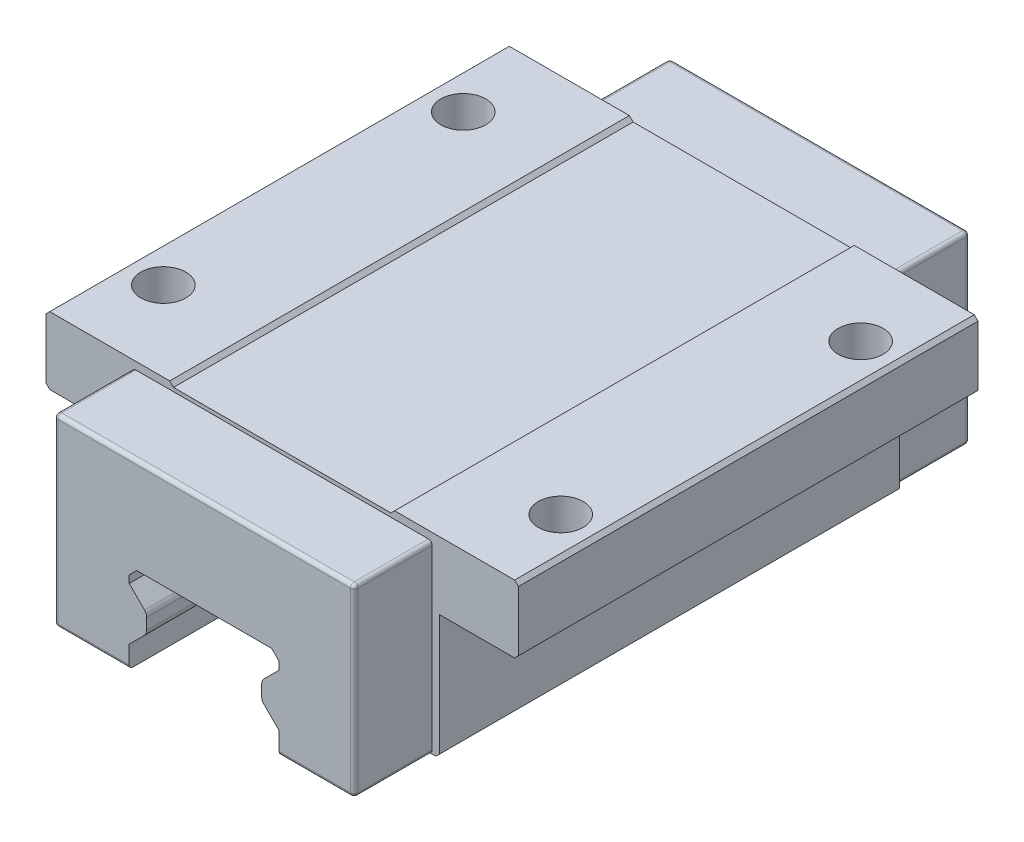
ISO-10303-21;
HEADER;
FILE_DESCRIPTION(('STEP AP214'),'2;1');
FILE_NAME('part.step','',(''),(''),'','','');
FILE_SCHEMA(('AUTOMOTIVE_DESIGN { 1 0 10303 214 1 1 1 1 }'));
ENDSEC;
DATA;
#1=APPLICATION_CONTEXT('core data for automotive mechanical design processes');
#2=APPLICATION_PROTOCOL_DEFINITION('international standard','automotive_design',2000,#1);
#3=PRODUCT_CONTEXT('',#1,'mechanical');
#4=PRODUCT('Part','Part','',(#3));
#5=PRODUCT_RELATED_PRODUCT_CATEGORY('part','',(#4));
#6=PRODUCT_DEFINITION_FORMATION('','',#4);
#7=PRODUCT_DEFINITION_CONTEXT('part definition',#1,'design');
#8=PRODUCT_DEFINITION('design','',#6,#7);
#9=PRODUCT_DEFINITION_SHAPE('','',#8);
#10=(LENGTH_UNIT() NAMED_UNIT(*) SI_UNIT(.MILLI.,.METRE.));
#11=(NAMED_UNIT(*) PLANE_ANGLE_UNIT() SI_UNIT($,.RADIAN.));
#12=(NAMED_UNIT(*) SI_UNIT($,.STERADIAN.) SOLID_ANGLE_UNIT());
#13=UNCERTAINTY_MEASURE_WITH_UNIT(LENGTH_MEASURE(1.E-05),#10,'distance_accuracy_value','');
#14=(GEOMETRIC_REPRESENTATION_CONTEXT(3) GLOBAL_UNCERTAINTY_ASSIGNED_CONTEXT((#13)) GLOBAL_UNIT_ASSIGNED_CONTEXT((#10,
#11,#12)) REPRESENTATION_CONTEXT('',''));
#15=CARTESIAN_POINT('',(0.,0.,0.));
#16=DIRECTION('',(0.,0.,1.));
#17=DIRECTION('',(1.,0.,0.));
#18=AXIS2_PLACEMENT_3D('',#15,#16,#17);
#19=CARTESIAN_POINT('',(31.5,21.,15.75));
#20=DIRECTION('',(0.,1.,0.));
#21=DIRECTION('',(0.,0.,1.));
#22=AXIS2_PLACEMENT_3D('',#19,#20,#21);
#23=PLANE('',#22);
#24=CARTESIAN_POINT('',(26.5,21.,-20.));
#25=DIRECTION('',(0.,-1.,0.));
#26=DIRECTION('',(-1.,0.,0.));
#27=AXIS2_PLACEMENT_3D('',#24,#25,#26);
#28=CIRCLE('',#27,3.);
#29=CARTESIAN_POINT('',(23.5,21.,-20.));
#30=VERTEX_POINT('',#29);
#31=EDGE_CURVE('E1700',#30,#30,#28,.T.);
#32=ORIENTED_EDGE('',*,*,#31,.F.);
#33=EDGE_LOOP('',(#32));
#34=FACE_BOUND('',#33,.T.);
#35=DIRECTION('',(-1.,0.,0.));
#36=VECTOR('',#35,1.);
#37=CARTESIAN_POINT('',(31.,21.,-15.75));
#38=LINE('',#37,#36);
#39=CARTESIAN_POINT('',(31.,21.,-15.75));
#40=VERTEX_POINT('',#39);
#41=CARTESIAN_POINT('',(26.,21.,-15.75));
#42=VERTEX_POINT('',#41);
#43=EDGE_CURVE('E1638',#40,#42,#38,.T.);
#44=ORIENTED_EDGE('',*,*,#43,.T.);
#45=CARTESIAN_POINT('',(26.,21.,-20.75));
#46=DIRECTION('',(0.,1.,0.));
#47=DIRECTION('',(0.,0.,1.));
#48=AXIS2_PLACEMENT_3D('',#45,#46,#47);
#49=CIRCLE('',#48,5.);
#50=CARTESIAN_POINT('',(21.,21.,-20.75));
#51=VERTEX_POINT('',#50);
#52=EDGE_CURVE('E477',#42,#51,#49,.F.);
#53=ORIENTED_EDGE('',*,*,#52,.T.);
#54=DIRECTION('',(0.,0.,-1.));
#55=VECTOR('',#54,1.);
#56=CARTESIAN_POINT('',(21.,21.,30.65));
#57=LINE('',#56,#55);
#58=CARTESIAN_POINT('',(21.,21.,-30.65));
#59=VERTEX_POINT('',#58);
#60=EDGE_CURVE('E471',#51,#59,#57,.T.);
#61=ORIENTED_EDGE('',*,*,#60,.T.);
#62=DIRECTION('',(1.,0.,0.));
#63=VECTOR('',#62,1.);
#64=CARTESIAN_POINT('',(31.5,21.,-30.65));
#65=LINE('',#64,#63);
#66=CARTESIAN_POINT('',(31.,21.,-30.65));
#67=VERTEX_POINT('',#66);
#68=EDGE_CURVE('E475',#59,#67,#65,.T.);
#69=ORIENTED_EDGE('',*,*,#68,.T.);
#70=DIRECTION('',(0.,0.,1.));
#71=VECTOR('',#70,1.);
#72=CARTESIAN_POINT('',(31.,21.,15.75));
#73=LINE('',#72,#71);
#74=EDGE_CURVE('E976',#67,#40,#73,.T.);
#75=ORIENTED_EDGE('',*,*,#74,.T.);
#76=EDGE_LOOP('',(#44,#53,#61,#69,#75));
#77=FACE_BOUND('',#76,.T.);
#78=ADVANCED_FACE('F39',(#34,#77),#23,.F.);
#79=CARTESIAN_POINT('',(-31.5,21.,15.75));
#80=DIRECTION('',(0.,1.,0.));
#81=DIRECTION('',(0.,0.,1.));
#82=AXIS2_PLACEMENT_3D('',#79,#80,#81);
#83=PLANE('',#82);
#84=CARTESIAN_POINT('',(-26.5,21.,20.));
#85=DIRECTION('',(0.,1.,0.));
#86=DIRECTION('',(-1.,0.,0.));
#87=AXIS2_PLACEMENT_3D('',#84,#85,#86);
#88=CIRCLE('',#87,3.);
#89=CARTESIAN_POINT('',(-29.5,21.,20.));
#90=VERTEX_POINT('',#89);
#91=EDGE_CURVE('E495',#90,#90,#88,.T.);
#92=ORIENTED_EDGE('',*,*,#91,.T.);
#93=EDGE_LOOP('',(#92));
#94=FACE_BOUND('',#93,.T.);
#95=DIRECTION('',(1.,0.,0.));
#96=VECTOR('',#95,1.);
#97=CARTESIAN_POINT('',(-31.,21.,15.75));
#98=LINE('',#97,#96);
#99=CARTESIAN_POINT('',(-31.,21.,15.75));
#100=VERTEX_POINT('',#99);
#101=CARTESIAN_POINT('',(-26.,21.,15.75));
#102=VERTEX_POINT('',#101);
#103=EDGE_CURVE('E1357',#100,#102,#98,.T.);
#104=ORIENTED_EDGE('',*,*,#103,.T.);
#105=CARTESIAN_POINT('',(-26.,21.,20.75));
#106=DIRECTION('',(0.,1.,0.));
#107=DIRECTION('',(0.,0.,1.));
#108=AXIS2_PLACEMENT_3D('',#105,#106,#107);
#109=CIRCLE('',#108,5.);
#110=CARTESIAN_POINT('',(-21.,21.,20.75));
#111=VERTEX_POINT('',#110);
#112=EDGE_CURVE('E986',#102,#111,#109,.F.);
#113=ORIENTED_EDGE('',*,*,#112,.T.);
#114=DIRECTION('',(0.,0.,1.));
#115=VECTOR('',#114,1.);
#116=CARTESIAN_POINT('',(-21.,21.,30.65));
#117=LINE('',#116,#115);
#118=CARTESIAN_POINT('',(-21.,21.,30.65));
#119=VERTEX_POINT('',#118);
#120=EDGE_CURVE('E1361',#111,#119,#117,.T.);
#121=ORIENTED_EDGE('',*,*,#120,.T.);
#122=DIRECTION('',(1.,0.,0.));
#123=VECTOR('',#122,1.);
#124=CARTESIAN_POINT('',(-31.5,21.,30.65));
#125=LINE('',#124,#123);
#126=CARTESIAN_POINT('',(-31.,21.,30.65));
#127=VERTEX_POINT('',#126);
#128=EDGE_CURVE('E1342',#127,#119,#125,.T.);
#129=ORIENTED_EDGE('',*,*,#128,.F.);
#130=DIRECTION('',(0.,0.,-1.));
#131=VECTOR('',#130,1.);
#132=CARTESIAN_POINT('',(-31.,21.,15.75));
#133=LINE('',#132,#131);
#134=EDGE_CURVE('E929',#127,#100,#133,.T.);
#135=ORIENTED_EDGE('',*,*,#134,.T.);
#136=EDGE_LOOP('',(#104,#113,#121,#129,#135));
#137=FACE_BOUND('',#136,.T.);
#138=ADVANCED_FACE('F1050',(#94,#137),#83,.F.);
#139=CARTESIAN_POINT('',(21.,4.4,30.65));
#140=DIRECTION('',(-1.,0.,0.));
#141=DIRECTION('',(0.,-1.,0.));
#142=AXIS2_PLACEMENT_3D('',#139,#140,#141);
#143=PLANE('',#142);
#144=ORIENTED_EDGE('',*,*,#60,.F.);
#145=DIRECTION('',(0.,1.,0.));
#146=VECTOR('',#145,1.);
#147=CARTESIAN_POINT('',(21.,11.,-20.75));
#148=LINE('',#147,#146);
#149=CARTESIAN_POINT('',(21.,11.,-20.75));
#150=VERTEX_POINT('',#149);
#151=EDGE_CURVE('E1013',#51,#150,#148,.F.);
#152=ORIENTED_EDGE('',*,*,#151,.T.);
#153=DIRECTION('',(0.,0.,-1.));
#154=VECTOR('',#153,1.);
#155=CARTESIAN_POINT('',(21.,11.,15.75));
#156=LINE('',#155,#154);
#157=CARTESIAN_POINT('',(21.,11.,20.75));
#158=VERTEX_POINT('',#157);
#159=EDGE_CURVE('E1368',#158,#150,#156,.T.);
#160=ORIENTED_EDGE('',*,*,#159,.F.);
#161=DIRECTION('',(0.,1.,0.));
#162=VECTOR('',#161,1.);
#163=CARTESIAN_POINT('',(21.,4.4,20.75));
#164=LINE('',#163,#162);
#165=CARTESIAN_POINT('',(21.,21.,20.75));
#166=VERTEX_POINT('',#165);
#167=EDGE_CURVE('E1009',#158,#166,#164,.T.);
#168=ORIENTED_EDGE('',*,*,#167,.T.);
#169=CARTESIAN_POINT('',(21.,21.,30.65));
#170=VERTEX_POINT('',#169);
#171=EDGE_CURVE('E483',#170,#166,#57,.T.);
#172=ORIENTED_EDGE('',*,*,#171,.F.);
#173=DIRECTION('',(0.,1.,0.));
#174=VECTOR('',#173,1.);
#175=CARTESIAN_POINT('',(21.,4.4,30.65));
#176=LINE('',#175,#174);
#177=CARTESIAN_POINT('',(21.,4.9,30.65));
#178=VERTEX_POINT('',#177);
#179=EDGE_CURVE('E527',#178,#170,#176,.T.);
#180=ORIENTED_EDGE('',*,*,#179,.F.);
#181=DIRECTION('',(0.,0.,-1.));
#182=VECTOR('',#181,1.);
#183=CARTESIAN_POINT('',(21.,4.9,30.65));
#184=LINE('',#183,#182);
#185=CARTESIAN_POINT('',(21.,4.9,-30.65));
#186=VERTEX_POINT('',#185);
#187=EDGE_CURVE('E501',#178,#186,#184,.T.);
#188=ORIENTED_EDGE('',*,*,#187,.T.);
#189=DIRECTION('',(0.,1.,0.));
#190=VECTOR('',#189,1.);
#191=CARTESIAN_POINT('',(21.,4.4,-30.65));
#192=LINE('',#191,#190);
#193=EDGE_CURVE('E490',#186,#59,#192,.T.);
#194=ORIENTED_EDGE('',*,*,#193,.T.);
#195=EDGE_LOOP('',(#144,#152,#160,#168,#172,#180,#188,#194));
#196=FACE_BOUND('',#195,.T.);
#197=ADVANCED_FACE('F498',(#196),#143,.F.);
#198=CARTESIAN_POINT('',(31.,11.,15.75));
#199=DIRECTION('',(0.,0.,1.));
#200=DIRECTION('',(1.,0.,0.));
#201=AXIS2_PLACEMENT_3D('',#198,#199,#200);
#202=PLANE('',#201);
#203=DIRECTION('',(-1.,0.,0.));
#204=VECTOR('',#203,1.);
#205=CARTESIAN_POINT('',(31.,21.,15.75));
#206=LINE('',#205,#204);
#207=CARTESIAN_POINT('',(31.,21.,15.75));
#208=VERTEX_POINT('',#207);
#209=CARTESIAN_POINT('',(26.,21.,15.75));
#210=VERTEX_POINT('',#209);
#211=EDGE_CURVE('E484',#208,#210,#206,.T.);
#212=ORIENTED_EDGE('',*,*,#211,.T.);
#213=DIRECTION('',(0.,1.,0.));
#214=VECTOR('',#213,1.);
#215=CARTESIAN_POINT('',(26.,11.,15.75));
#216=LINE('',#215,#214);
#217=CARTESIAN_POINT('',(26.,19.6602540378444,15.75));
#218=VERTEX_POINT('',#217);
#219=EDGE_CURVE('E60',#210,#218,#216,.F.);
#220=ORIENTED_EDGE('',*,*,#219,.T.);
#221=CARTESIAN_POINT('',(31.,11.,15.75));
#222=DIRECTION('',(0.,0.,-1.));
#223=DIRECTION('',(1.,0.,0.));
#224=AXIS2_PLACEMENT_3D('',#221,#222,#223);
#225=CIRCLE('',#224,10.);
#226=EDGE_CURVE('E1365',#218,#208,#225,.T.);
#227=ORIENTED_EDGE('',*,*,#226,.T.);
#228=EDGE_LOOP('',(#212,#220,#227));
#229=FACE_BOUND('',#228,.T.);
#230=ADVANCED_FACE('F1147',(#229),#202,.T.);
#231=CARTESIAN_POINT('',(31.,11.,-15.75));
#232=DIRECTION('',(0.,0.,1.));
#233=DIRECTION('',(1.,0.,0.));
#234=AXIS2_PLACEMENT_3D('',#231,#232,#233);
#235=PLANE('',#234);
#236=CARTESIAN_POINT('',(31.,11.,-15.75));
#237=DIRECTION('',(0.,0.,-1.));
#238=DIRECTION('',(1.,0.,0.));
#239=AXIS2_PLACEMENT_3D('',#236,#237,#238);
#240=CIRCLE('',#239,10.);
#241=CARTESIAN_POINT('',(26.,19.6602540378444,-15.75));
#242=VERTEX_POINT('',#241);
#243=EDGE_CURVE('E1369',#242,#40,#240,.T.);
#244=ORIENTED_EDGE('',*,*,#243,.F.);
#245=DIRECTION('',(0.,1.,0.));
#246=VECTOR('',#245,1.);
#247=CARTESIAN_POINT('',(26.,21.,-15.75));
#248=LINE('',#247,#246);
#249=EDGE_CURVE('E1003',#242,#42,#248,.T.);
#250=ORIENTED_EDGE('',*,*,#249,.T.);
#251=ORIENTED_EDGE('',*,*,#43,.F.);
#252=EDGE_LOOP('',(#244,#250,#251));
#253=FACE_BOUND('',#252,.T.);
#254=ADVANCED_FACE('F1139',(#253),#235,.F.);
#255=CARTESIAN_POINT('',(-21.,4.4,30.65));
#256=DIRECTION('',(1.,0.,0.));
#257=DIRECTION('',(0.,1.,0.));
#258=AXIS2_PLACEMENT_3D('',#255,#256,#257);
#259=PLANE('',#258);
#260=ORIENTED_EDGE('',*,*,#120,.F.);
#261=DIRECTION('',(0.,1.,0.));
#262=VECTOR('',#261,1.);
#263=CARTESIAN_POINT('',(-21.,11.,20.75));
#264=LINE('',#263,#262);
#265=CARTESIAN_POINT('',(-21.,11.,20.75));
#266=VERTEX_POINT('',#265);
#267=EDGE_CURVE('E993',#111,#266,#264,.F.);
#268=ORIENTED_EDGE('',*,*,#267,.T.);
#269=DIRECTION('',(0.,0.,-1.));
#270=VECTOR('',#269,1.);
#271=CARTESIAN_POINT('',(-21.,11.,15.75));
#272=LINE('',#271,#270);
#273=CARTESIAN_POINT('',(-21.,11.,-20.75));
#274=VERTEX_POINT('',#273);
#275=EDGE_CURVE('E1383',#266,#274,#272,.T.);
#276=ORIENTED_EDGE('',*,*,#275,.T.);
#277=DIRECTION('',(0.,1.,0.));
#278=VECTOR('',#277,1.);
#279=CARTESIAN_POINT('',(-21.,4.4,-20.75));
#280=LINE('',#279,#278);
#281=CARTESIAN_POINT('',(-21.,21.,-20.75));
#282=VERTEX_POINT('',#281);
#283=EDGE_CURVE('E989',#274,#282,#280,.T.);
#284=ORIENTED_EDGE('',*,*,#283,.T.);
#285=CARTESIAN_POINT('',(-21.,21.,-30.65));
#286=VERTEX_POINT('',#285);
#287=EDGE_CURVE('E1364',#286,#282,#117,.T.);
#288=ORIENTED_EDGE('',*,*,#287,.F.);
#289=DIRECTION('',(0.,-1.,0.));
#290=VECTOR('',#289,1.);
#291=CARTESIAN_POINT('',(-21.,4.4,-30.65));
#292=LINE('',#291,#290);
#293=CARTESIAN_POINT('',(-21.,4.9,-30.65));
#294=VERTEX_POINT('',#293);
#295=EDGE_CURVE('E520',#286,#294,#292,.T.);
#296=ORIENTED_EDGE('',*,*,#295,.T.);
#297=DIRECTION('',(0.,0.,1.));
#298=VECTOR('',#297,1.);
#299=CARTESIAN_POINT('',(-21.,4.9,30.65));
#300=LINE('',#299,#298);
#301=CARTESIAN_POINT('',(-21.,4.9,30.65));
#302=VERTEX_POINT('',#301);
#303=EDGE_CURVE('E654',#294,#302,#300,.T.);
#304=ORIENTED_EDGE('',*,*,#303,.T.);
#305=DIRECTION('',(0.,-1.,0.));
#306=VECTOR('',#305,1.);
#307=CARTESIAN_POINT('',(-21.,4.4,30.65));
#308=LINE('',#307,#306);
#309=EDGE_CURVE('E1498',#119,#302,#308,.T.);
#310=ORIENTED_EDGE('',*,*,#309,.F.);
#311=EDGE_LOOP('',(#260,#268,#276,#284,#288,#296,#304,#310));
#312=FACE_BOUND('',#311,.T.);
#313=ADVANCED_FACE('F1135',(#312),#259,.F.);
#314=CARTESIAN_POINT('',(-31.,11.,15.75));
#315=DIRECTION('',(0.,0.,-1.));
#316=DIRECTION('',(-1.,0.,0.));
#317=AXIS2_PLACEMENT_3D('',#314,#315,#316);
#318=PLANE('',#317);
#319=CARTESIAN_POINT('',(-31.,11.,15.75));
#320=DIRECTION('',(0.,0.,-1.));
#321=DIRECTION('',(-1.,0.,0.));
#322=AXIS2_PLACEMENT_3D('',#319,#320,#321);
#323=CIRCLE('',#322,10.);
#324=CARTESIAN_POINT('',(-26.,19.6602540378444,15.75));
#325=VERTEX_POINT('',#324);
#326=EDGE_CURVE('E1379',#100,#325,#323,.T.);
#327=ORIENTED_EDGE('',*,*,#326,.T.);
#328=DIRECTION('',(0.,1.,0.));
#329=VECTOR('',#328,1.);
#330=CARTESIAN_POINT('',(-26.,21.,15.75));
#331=LINE('',#330,#329);
#332=EDGE_CURVE('E982',#325,#102,#331,.T.);
#333=ORIENTED_EDGE('',*,*,#332,.T.);
#334=ORIENTED_EDGE('',*,*,#103,.F.);
#335=EDGE_LOOP('',(#327,#333,#334));
#336=FACE_BOUND('',#335,.T.);
#337=ADVANCED_FACE('F1138',(#336),#318,.F.);
#338=CARTESIAN_POINT('',(-31.,11.,-15.75));
#339=DIRECTION('',(0.,0.,-1.));
#340=DIRECTION('',(-1.,0.,0.));
#341=AXIS2_PLACEMENT_3D('',#338,#339,#340);
#342=PLANE('',#341);
#343=DIRECTION('',(1.,0.,0.));
#344=VECTOR('',#343,1.);
#345=CARTESIAN_POINT('',(-31.,21.,-15.75));
#346=LINE('',#345,#344);
#347=CARTESIAN_POINT('',(-31.,21.,-15.75));
#348=VERTEX_POINT('',#347);
#349=CARTESIAN_POINT('',(-26.,21.,-15.75));
#350=VERTEX_POINT('',#349);
#351=EDGE_CURVE('E1349',#348,#350,#346,.T.);
#352=ORIENTED_EDGE('',*,*,#351,.T.);
#353=DIRECTION('',(0.,1.,0.));
#354=VECTOR('',#353,1.);
#355=CARTESIAN_POINT('',(-26.,11.,-15.75));
#356=LINE('',#355,#354);
#357=CARTESIAN_POINT('',(-26.,19.6602540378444,-15.75));
#358=VERTEX_POINT('',#357);
#359=EDGE_CURVE('E1000',#350,#358,#356,.F.);
#360=ORIENTED_EDGE('',*,*,#359,.T.);
#361=CARTESIAN_POINT('',(-31.,11.,-15.75));
#362=DIRECTION('',(0.,0.,-1.));
#363=DIRECTION('',(-1.,0.,0.));
#364=AXIS2_PLACEMENT_3D('',#361,#362,#363);
#365=CIRCLE('',#364,10.);
#366=EDGE_CURVE('E1378',#348,#358,#365,.T.);
#367=ORIENTED_EDGE('',*,*,#366,.F.);
#368=EDGE_LOOP('',(#352,#360,#367));
#369=FACE_BOUND('',#368,.T.);
#370=ADVANCED_FACE('F1043',(#369),#342,.T.);
#371=CARTESIAN_POINT('',(-21.,30.,30.65));
#372=DIRECTION('',(0.,-1.,0.));
#373=DIRECTION('',(1.,0.,0.));
#374=AXIS2_PLACEMENT_3D('',#371,#372,#373);
#375=PLANE('',#374);
#376=CARTESIAN_POINT('',(-26.5,30.,-20.));
#377=DIRECTION('',(0.,-1.,0.));
#378=DIRECTION('',(-1.,0.,0.));
#379=AXIS2_PLACEMENT_3D('',#376,#377,#378);
#380=CIRCLE('',#379,3.);
#381=CARTESIAN_POINT('',(-29.5,30.,-20.));
#382=VERTEX_POINT('',#381);
#383=EDGE_CURVE('E1702',#382,#382,#380,.T.);
#384=ORIENTED_EDGE('',*,*,#383,.T.);
#385=EDGE_LOOP('',(#384));
#386=FACE_BOUND('',#385,.T.);
#387=CARTESIAN_POINT('',(-26.5,30.,20.));
#388=DIRECTION('',(0.,1.,0.));
#389=DIRECTION('',(-1.,0.,0.));
#390=AXIS2_PLACEMENT_3D('',#387,#388,#389);
#391=CIRCLE('',#390,3.);
#392=CARTESIAN_POINT('',(-29.5,30.,20.));
#393=VERTEX_POINT('',#392);
#394=EDGE_CURVE('E2440',#393,#393,#391,.T.);
#395=ORIENTED_EDGE('',*,*,#394,.F.);
#396=EDGE_LOOP('',(#395));
#397=FACE_BOUND('',#396,.T.);
#398=DIRECTION('',(-1.,0.,0.));
#399=VECTOR('',#398,1.);
#400=CARTESIAN_POINT('',(-21.,30.,-30.65));
#401=LINE('',#400,#399);
#402=CARTESIAN_POINT('',(-15.,30.,-30.65));
#403=VERTEX_POINT('',#402);
#404=CARTESIAN_POINT('',(-31.,30.,-30.65));
#405=VERTEX_POINT('',#404);
#406=EDGE_CURVE('E503',#403,#405,#401,.T.);
#407=ORIENTED_EDGE('',*,*,#406,.T.);
#408=DIRECTION('',(0.,0.,1.));
#409=VECTOR('',#408,1.);
#410=CARTESIAN_POINT('',(-31.,30.,30.65));
#411=LINE('',#410,#409);
#412=CARTESIAN_POINT('',(-31.,30.,30.65));
#413=VERTEX_POINT('',#412);
#414=EDGE_CURVE('E963',#405,#413,#411,.T.);
#415=ORIENTED_EDGE('',*,*,#414,.T.);
#416=DIRECTION('',(-1.,0.,0.));
#417=VECTOR('',#416,1.);
#418=CARTESIAN_POINT('',(-21.,30.,30.65));
#419=LINE('',#418,#417);
#420=CARTESIAN_POINT('',(-15.,30.,30.65));
#421=VERTEX_POINT('',#420);
#422=EDGE_CURVE('E1495',#421,#413,#419,.T.);
#423=ORIENTED_EDGE('',*,*,#422,.F.);
#424=DIRECTION('',(0.,0.,-1.));
#425=VECTOR('',#424,1.);
#426=CARTESIAN_POINT('',(-15.,30.,30.65));
#427=LINE('',#426,#425);
#428=EDGE_CURVE('E625',#421,#403,#427,.T.);
#429=ORIENTED_EDGE('',*,*,#428,.T.);
#430=EDGE_LOOP('',(#407,#415,#423,#429));
#431=FACE_BOUND('',#430,.T.);
#432=ADVANCED_FACE('F1144',(#386,#397,#431),#375,.F.);
#433=CARTESIAN_POINT('',(10.,16.3,-41.05));
#434=DIRECTION('',(1.,0.,0.));
#435=DIRECTION('',(0.,1.,0.));
#436=AXIS2_PLACEMENT_3D('',#433,#434,#435);
#437=PLANE('',#436);
#438=DIRECTION('',(0.,-1.,0.));
#439=VECTOR('',#438,1.);
#440=CARTESIAN_POINT('',(10.,0.,41.05));
#441=LINE('',#440,#439);
#442=CARTESIAN_POINT('',(10.,15.3,41.05));
#443=VERTEX_POINT('',#442);
#444=CARTESIAN_POINT('',(10.,14.3,41.05));
#445=VERTEX_POINT('',#444);
#446=EDGE_CURVE('E540',#443,#445,#441,.T.);
#447=ORIENTED_EDGE('',*,*,#446,.F.);
#448=DIRECTION('',(0.,0.,-1.));
#449=VECTOR('',#448,1.);
#450=CARTESIAN_POINT('',(10.,15.3,-41.05));
#451=LINE('',#450,#449);
#452=CARTESIAN_POINT('',(10.,15.3,-41.05));
#453=VERTEX_POINT('',#452);
#454=EDGE_CURVE('E550',#443,#453,#451,.T.);
#455=ORIENTED_EDGE('',*,*,#454,.T.);
#456=DIRECTION('',(0.,1.,0.));
#457=VECTOR('',#456,1.);
#458=CARTESIAN_POINT('',(10.,16.3,-41.05));
#459=LINE('',#458,#457);
#460=CARTESIAN_POINT('',(10.,14.3,-41.05));
#461=VERTEX_POINT('',#460);
#462=EDGE_CURVE('E1461',#461,#453,#459,.T.);
#463=ORIENTED_EDGE('',*,*,#462,.F.);
#464=DIRECTION('',(0.,0.,1.));
#465=VECTOR('',#464,1.);
#466=CARTESIAN_POINT('',(10.,14.3,-48.4286478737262));
#467=LINE('',#466,#465);
#468=EDGE_CURVE('E1400',#461,#445,#467,.T.);
#469=ORIENTED_EDGE('',*,*,#468,.T.);
#470=EDGE_LOOP('',(#447,#455,#463,#469));
#471=FACE_BOUND('',#470,.T.);
#472=ADVANCED_FACE('F1100',(#471),#437,.F.);
#473=CARTESIAN_POINT('',(-10.,16.3,-41.05));
#474=DIRECTION('',(-1.,0.,0.));
#475=DIRECTION('',(0.,-1.,0.));
#476=AXIS2_PLACEMENT_3D('',#473,#474,#475);
#477=PLANE('',#476);
#478=DIRECTION('',(0.,-1.,0.));
#479=VECTOR('',#478,1.);
#480=CARTESIAN_POINT('',(-10.,16.3,41.05));
#481=LINE('',#480,#479);
#482=CARTESIAN_POINT('',(-10.,7.3,41.05));
#483=VERTEX_POINT('',#482);
#484=CARTESIAN_POINT('',(-10.,4.9,41.05));
#485=VERTEX_POINT('',#484);
#486=EDGE_CURVE('E1474',#483,#485,#481,.T.);
#487=ORIENTED_EDGE('',*,*,#486,.T.);
#488=CARTESIAN_POINT('',(-10.,4.9,40.55));
#489=DIRECTION('',(-1.,0.,0.));
#490=DIRECTION('',(0.,-1.,0.));
#491=AXIS2_PLACEMENT_3D('',#488,#489,#490);
#492=CIRCLE('',#491,0.5);
#493=CARTESIAN_POINT('',(-10.,4.4,40.55));
#494=VERTEX_POINT('',#493);
#495=EDGE_CURVE('E763',#485,#494,#492,.F.);
#496=ORIENTED_EDGE('',*,*,#495,.T.);
#497=DIRECTION('',(0.,0.,1.));
#498=VECTOR('',#497,1.);
#499=CARTESIAN_POINT('',(-10.,4.4,30.65));
#500=LINE('',#499,#498);
#501=CARTESIAN_POINT('',(-10.,4.4,-40.55));
#502=VERTEX_POINT('',#501);
#503=EDGE_CURVE('E1470',#502,#494,#500,.T.);
#504=ORIENTED_EDGE('',*,*,#503,.F.);
#505=CARTESIAN_POINT('',(-10.,4.9,-40.55));
#506=DIRECTION('',(-1.,0.,0.));
#507=DIRECTION('',(0.,-1.,0.));
#508=AXIS2_PLACEMENT_3D('',#505,#506,#507);
#509=CIRCLE('',#508,0.5);
#510=CARTESIAN_POINT('',(-10.,4.9,-41.05));
#511=VERTEX_POINT('',#510);
#512=EDGE_CURVE('E760',#502,#511,#509,.F.);
#513=ORIENTED_EDGE('',*,*,#512,.T.);
#514=DIRECTION('',(0.,-1.,0.));
#515=VECTOR('',#514,1.);
#516=CARTESIAN_POINT('',(-10.,16.3,-41.05));
#517=LINE('',#516,#515);
#518=CARTESIAN_POINT('',(-10.,7.3,-41.05));
#519=VERTEX_POINT('',#518);
#520=EDGE_CURVE('E1465',#519,#511,#517,.T.);
#521=ORIENTED_EDGE('',*,*,#520,.F.);
#522=DIRECTION('',(0.,0.,1.));
#523=VECTOR('',#522,1.);
#524=CARTESIAN_POINT('',(-10.,7.3,-48.4286478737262));
#525=LINE('',#524,#523);
#526=EDGE_CURVE('E1431',#519,#483,#525,.T.);
#527=ORIENTED_EDGE('',*,*,#526,.T.);
#528=EDGE_LOOP('',(#487,#496,#504,#513,#521,#527));
#529=FACE_BOUND('',#528,.T.);
#530=ADVANCED_FACE('F1092',(#529),#477,.F.);
#531=CARTESIAN_POINT('',(-21.,4.4,30.65));
#532=DIRECTION('',(0.,1.,0.));
#533=DIRECTION('',(-1.,0.,0.));
#534=AXIS2_PLACEMENT_3D('',#531,#532,#533);
#535=PLANE('',#534);
#536=DIRECTION('',(0.,0.,-1.));
#537=VECTOR('',#536,1.);
#538=CARTESIAN_POINT('',(19.5,4.4,30.65));
#539=LINE('',#538,#537);
#540=CARTESIAN_POINT('',(19.5,4.4,30.65));
#541=VERTEX_POINT('',#540);
#542=CARTESIAN_POINT('',(19.5,4.4,40.55));
#543=VERTEX_POINT('',#542);
#544=EDGE_CURVE('E709',#541,#543,#539,.F.);
#545=ORIENTED_EDGE('',*,*,#544,.T.);
#546=DIRECTION('',(1.,0.,0.));
#547=VECTOR('',#546,1.);
#548=CARTESIAN_POINT('',(-21.,4.4,40.55));
#549=LINE('',#548,#547);
#550=CARTESIAN_POINT('',(10.,4.4,40.55));
#551=VERTEX_POINT('',#550);
#552=EDGE_CURVE('E712',#543,#551,#549,.F.);
#553=ORIENTED_EDGE('',*,*,#552,.T.);
#554=DIRECTION('',(0.,0.,-1.));
#555=VECTOR('',#554,1.);
#556=CARTESIAN_POINT('',(10.,4.4,30.65));
#557=LINE('',#556,#555);
#558=CARTESIAN_POINT('',(10.,4.4,-40.55));
#559=VERTEX_POINT('',#558);
#560=EDGE_CURVE('E1482',#551,#559,#557,.T.);
#561=ORIENTED_EDGE('',*,*,#560,.T.);
#562=DIRECTION('',(1.,0.,0.));
#563=VECTOR('',#562,1.);
#564=CARTESIAN_POINT('',(20.,4.4,-40.55));
#565=LINE('',#564,#563);
#566=CARTESIAN_POINT('',(19.5,4.4,-40.55));
#567=VERTEX_POINT('',#566);
#568=EDGE_CURVE('E706',#559,#567,#565,.T.);
#569=ORIENTED_EDGE('',*,*,#568,.T.);
#570=DIRECTION('',(0.,0.,-1.));
#571=VECTOR('',#570,1.);
#572=CARTESIAN_POINT('',(19.5,4.4,30.65));
#573=LINE('',#572,#571);
#574=CARTESIAN_POINT('',(19.5,4.4,-30.65));
#575=VERTEX_POINT('',#574);
#576=EDGE_CURVE('E702',#567,#575,#573,.F.);
#577=ORIENTED_EDGE('',*,*,#576,.T.);
#578=DIRECTION('',(1.,0.,0.));
#579=VECTOR('',#578,1.);
#580=CARTESIAN_POINT('',(-21.,4.4,-30.65));
#581=LINE('',#580,#579);
#582=CARTESIAN_POINT('',(20.5,4.4,-30.65));
#583=VERTEX_POINT('',#582);
#584=EDGE_CURVE('E523',#575,#583,#581,.T.);
#585=ORIENTED_EDGE('',*,*,#584,.T.);
#586=DIRECTION('',(0.,0.,1.));
#587=VECTOR('',#586,1.);
#588=CARTESIAN_POINT('',(20.5,4.4,30.65));
#589=LINE('',#588,#587);
#590=CARTESIAN_POINT('',(20.5,4.4,30.65));
#591=VERTEX_POINT('',#590);
#592=EDGE_CURVE('E647',#583,#591,#589,.T.);
#593=ORIENTED_EDGE('',*,*,#592,.T.);
#594=DIRECTION('',(1.,0.,0.));
#595=VECTOR('',#594,1.);
#596=CARTESIAN_POINT('',(-21.,4.4,30.65));
#597=LINE('',#596,#595);
#598=EDGE_CURVE('E1500',#541,#591,#597,.T.);
#599=ORIENTED_EDGE('',*,*,#598,.F.);
#600=EDGE_LOOP('',(#545,#553,#561,#569,#577,#585,#593,#599));
#601=FACE_BOUND('',#600,.T.);
#602=ADVANCED_FACE('F1127',(#601),#535,.F.);
#603=CARTESIAN_POINT('',(0.,0.,30.65));
#604=DIRECTION('',(0.,0.,-1.));
#605=DIRECTION('',(-1.,0.,0.));
#606=AXIS2_PLACEMENT_3D('',#603,#604,#605);
#607=PLANE('',#606);
#608=DIRECTION('',(0.,-1.,0.));
#609=VECTOR('',#608,1.);
#610=CARTESIAN_POINT('',(-31.5,21.,30.65));
#611=LINE('',#610,#609);
#612=CARTESIAN_POINT('',(-31.5,29.5,30.65));
#613=VERTEX_POINT('',#612);
#614=CARTESIAN_POINT('',(-31.5,21.5,30.65));
#615=VERTEX_POINT('',#614);
#616=EDGE_CURVE('E1346',#613,#615,#611,.T.);
#617=ORIENTED_EDGE('',*,*,#616,.T.);
#618=DIRECTION('',(-0.707106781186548,0.707106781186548,0.));
#619=VECTOR('',#618,1.);
#620=CARTESIAN_POINT('',(-31.,21.,30.65));
#621=LINE('',#620,#619);
#622=EDGE_CURVE('E960',#615,#127,#621,.F.);
#623=ORIENTED_EDGE('',*,*,#622,.T.);
#624=ORIENTED_EDGE('',*,*,#128,.T.);
#625=ORIENTED_EDGE('',*,*,#309,.T.);
#626=DIRECTION('',(-0.707106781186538,0.707106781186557,0.));
#627=VECTOR('',#626,1.);
#628=CARTESIAN_POINT('',(-20.5,4.4,30.65));
#629=LINE('',#628,#627);
#630=CARTESIAN_POINT('',(-20.5,4.4,30.65));
#631=VERTEX_POINT('',#630);
#632=EDGE_CURVE('E641',#302,#631,#629,.F.);
#633=ORIENTED_EDGE('',*,*,#632,.T.);
#634=CARTESIAN_POINT('',(-19.5,4.4,30.65));
#635=VERTEX_POINT('',#634);
#636=EDGE_CURVE('E516',#631,#635,#597,.T.);
#637=ORIENTED_EDGE('',*,*,#636,.T.);
#638=CARTESIAN_POINT('',(-19.5,4.9,30.65));
#639=DIRECTION('',(0.,0.,-1.));
#640=DIRECTION('',(-1.,0.,0.));
#641=AXIS2_PLACEMENT_3D('',#638,#639,#640);
#642=CIRCLE('',#641,0.5);
#643=CARTESIAN_POINT('',(-20.,4.9,30.65));
#644=VERTEX_POINT('',#643);
#645=EDGE_CURVE('E806',#635,#644,#642,.T.);
#646=ORIENTED_EDGE('',*,*,#645,.T.);
#647=DIRECTION('',(0.,-1.,0.));
#648=VECTOR('',#647,1.);
#649=CARTESIAN_POINT('',(-20.,0.,30.65));
#650=LINE('',#649,#648);
#651=CARTESIAN_POINT('',(-20.,28.5,30.65));
#652=VERTEX_POINT('',#651);
#653=EDGE_CURVE('E504',#652,#644,#650,.T.);
#654=ORIENTED_EDGE('',*,*,#653,.F.);
#655=CARTESIAN_POINT('',(-19.5,28.5,30.65));
#656=DIRECTION('',(0.,0.,-1.));
#657=DIRECTION('',(-1.,0.,0.));
#658=AXIS2_PLACEMENT_3D('',#655,#656,#657);
#659=CIRCLE('',#658,0.5);
#660=CARTESIAN_POINT('',(-19.5,29.,30.65));
#661=VERTEX_POINT('',#660);
#662=EDGE_CURVE('E814',#652,#661,#659,.T.);
#663=ORIENTED_EDGE('',*,*,#662,.T.);
#664=DIRECTION('',(-1.,0.,0.));
#665=VECTOR('',#664,1.);
#666=CARTESIAN_POINT('',(0.,29.,30.65));
#667=LINE('',#666,#665);
#668=CARTESIAN_POINT('',(19.5,29.,30.65));
#669=VERTEX_POINT('',#668);
#670=EDGE_CURVE('E1486',#669,#661,#667,.T.);
#671=ORIENTED_EDGE('',*,*,#670,.F.);
#672=CARTESIAN_POINT('',(19.5,28.5,30.65));
#673=DIRECTION('',(0.,0.,-1.));
#674=DIRECTION('',(-1.,0.,0.));
#675=AXIS2_PLACEMENT_3D('',#672,#673,#674);
#676=CIRCLE('',#675,0.5);
#677=CARTESIAN_POINT('',(20.,28.5,30.65));
#678=VERTEX_POINT('',#677);
#679=EDGE_CURVE('E817',#669,#678,#676,.T.);
#680=ORIENTED_EDGE('',*,*,#679,.T.);
#681=DIRECTION('',(0.,1.,0.));
#682=VECTOR('',#681,1.);
#683=CARTESIAN_POINT('',(20.,0.,30.65));
#684=LINE('',#683,#682);
#685=CARTESIAN_POINT('',(20.,4.9,30.65));
#686=VERTEX_POINT('',#685);
#687=EDGE_CURVE('E513',#686,#678,#684,.T.);
#688=ORIENTED_EDGE('',*,*,#687,.F.);
#689=CARTESIAN_POINT('',(19.5,4.9,30.65));
#690=DIRECTION('',(0.,0.,-1.));
#691=DIRECTION('',(-1.,0.,0.));
#692=AXIS2_PLACEMENT_3D('',#689,#690,#691);
#693=CIRCLE('',#692,0.5);
#694=EDGE_CURVE('E810',#686,#541,#693,.T.);
#695=ORIENTED_EDGE('',*,*,#694,.T.);
#696=ORIENTED_EDGE('',*,*,#598,.T.);
#697=DIRECTION('',(-0.707106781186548,-0.707106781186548,0.));
#698=VECTOR('',#697,1.);
#699=CARTESIAN_POINT('',(21.,4.9,30.65));
#700=LINE('',#699,#698);
#701=EDGE_CURVE('E644',#591,#178,#700,.F.);
#702=ORIENTED_EDGE('',*,*,#701,.T.);
#703=ORIENTED_EDGE('',*,*,#179,.T.);
#704=DIRECTION('',(1.,0.,0.));
#705=VECTOR('',#704,1.);
#706=CARTESIAN_POINT('',(31.5,21.,30.65));
#707=LINE('',#706,#705);
#708=CARTESIAN_POINT('',(31.,21.,30.65));
#709=VERTEX_POINT('',#708);
#710=EDGE_CURVE('E1332',#170,#709,#707,.T.);
#711=ORIENTED_EDGE('',*,*,#710,.T.);
#712=DIRECTION('',(-0.707106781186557,-0.707106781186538,0.));
#713=VECTOR('',#712,1.);
#714=CARTESIAN_POINT('',(31.5,21.5,30.65));
#715=LINE('',#714,#713);
#716=CARTESIAN_POINT('',(31.5,21.5,30.65));
#717=VERTEX_POINT('',#716);
#718=EDGE_CURVE('E954',#709,#717,#715,.F.);
#719=ORIENTED_EDGE('',*,*,#718,.T.);
#720=DIRECTION('',(0.,1.,0.));
#721=VECTOR('',#720,1.);
#722=CARTESIAN_POINT('',(31.5,21.,30.65));
#723=LINE('',#722,#721);
#724=CARTESIAN_POINT('',(31.5,29.5,30.65));
#725=VERTEX_POINT('',#724);
#726=EDGE_CURVE('E1634',#717,#725,#723,.T.);
#727=ORIENTED_EDGE('',*,*,#726,.T.);
#728=DIRECTION('',(0.707106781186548,-0.707106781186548,0.));
#729=VECTOR('',#728,1.);
#730=CARTESIAN_POINT('',(31.,30.,30.65));
#731=LINE('',#730,#729);
#732=CARTESIAN_POINT('',(31.,30.,30.65));
#733=VERTEX_POINT('',#732);
#734=EDGE_CURVE('E951',#725,#733,#731,.F.);
#735=ORIENTED_EDGE('',*,*,#734,.T.);
#736=CARTESIAN_POINT('',(15.,30.,30.65));
#737=VERTEX_POINT('',#736);
#738=EDGE_CURVE('E1496',#733,#737,#419,.T.);
#739=ORIENTED_EDGE('',*,*,#738,.T.);
#740=DIRECTION('',(0.707106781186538,0.707106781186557,0.));
#741=VECTOR('',#740,1.);
#742=CARTESIAN_POINT('',(-7.4999999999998,7.49999999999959,30.65));
#743=LINE('',#742,#741);
#744=CARTESIAN_POINT('',(14.5,29.5,30.65));
#745=VERTEX_POINT('',#744);
#746=EDGE_CURVE('E665',#737,#745,#743,.F.);
#747=ORIENTED_EDGE('',*,*,#746,.T.);
#748=DIRECTION('',(1.,0.,0.));
#749=VECTOR('',#748,1.);
#750=CARTESIAN_POINT('',(-15.,29.5,30.65));
#751=LINE('',#750,#749);
#752=CARTESIAN_POINT('',(-14.5,29.5,30.65));
#753=VERTEX_POINT('',#752);
#754=EDGE_CURVE('E878',#753,#745,#751,.T.);
#755=ORIENTED_EDGE('',*,*,#754,.F.);
#756=DIRECTION('',(0.707106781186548,-0.707106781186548,0.));
#757=VECTOR('',#756,1.);
#758=CARTESIAN_POINT('',(7.50000000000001,7.50000000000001,30.65));
#759=LINE('',#758,#757);
#760=EDGE_CURVE('E672',#753,#421,#759,.F.);
#761=ORIENTED_EDGE('',*,*,#760,.T.);
#762=ORIENTED_EDGE('',*,*,#422,.T.);
#763=DIRECTION('',(0.707106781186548,0.707106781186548,0.));
#764=VECTOR('',#763,1.);
#765=CARTESIAN_POINT('',(-31.5,29.5,30.65));
#766=LINE('',#765,#764);
#767=EDGE_CURVE('E957',#413,#613,#766,.F.);
#768=ORIENTED_EDGE('',*,*,#767,.T.);
#769=EDGE_LOOP('',(#617,#623,#624,#625,#633,#637,#646,#654,#663,#671,#680,#688,#695,#696,#702,
#703,#711,#719,#727,#735,#739,#747,#755,#761,#762,#768));
#770=FACE_BOUND('',#769,.T.);
#771=ADVANCED_FACE('F1124',(#770),#607,.F.);
#772=CARTESIAN_POINT('',(0.,0.,-30.65));
#773=DIRECTION('',(0.,0.,-1.));
#774=DIRECTION('',(-1.,0.,0.));
#775=AXIS2_PLACEMENT_3D('',#772,#773,#774);
#776=PLANE('',#775);
#777=DIRECTION('',(1.,0.,0.));
#778=VECTOR('',#777,1.);
#779=CARTESIAN_POINT('',(-31.5,21.,-30.65));
#780=LINE('',#779,#778);
#781=CARTESIAN_POINT('',(-31.,21.,-30.65));
#782=VERTEX_POINT('',#781);
#783=EDGE_CURVE('E1335',#782,#286,#780,.T.);
#784=ORIENTED_EDGE('',*,*,#783,.F.);
#785=DIRECTION('',(0.707106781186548,-0.707106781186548,0.));
#786=VECTOR('',#785,1.);
#787=CARTESIAN_POINT('',(-5.,-5.,-30.65));
#788=LINE('',#787,#786);
#789=CARTESIAN_POINT('',(-31.5,21.5,-30.65));
#790=VERTEX_POINT('',#789);
#791=EDGE_CURVE('E941',#782,#790,#788,.F.);
#792=ORIENTED_EDGE('',*,*,#791,.T.);
#793=DIRECTION('',(0.,-1.,0.));
#794=VECTOR('',#793,1.);
#795=CARTESIAN_POINT('',(-31.5,21.,-30.65));
#796=LINE('',#795,#794);
#797=CARTESIAN_POINT('',(-31.5,29.5,-30.65));
#798=VERTEX_POINT('',#797);
#799=EDGE_CURVE('E1337',#798,#790,#796,.T.);
#800=ORIENTED_EDGE('',*,*,#799,.F.);
#801=DIRECTION('',(-0.707106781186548,-0.707106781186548,0.));
#802=VECTOR('',#801,1.);
#803=CARTESIAN_POINT('',(-30.5,30.5,-30.65));
#804=LINE('',#803,#802);
#805=EDGE_CURVE('E938',#798,#405,#804,.F.);
#806=ORIENTED_EDGE('',*,*,#805,.T.);
#807=ORIENTED_EDGE('',*,*,#406,.F.);
#808=DIRECTION('',(-0.707106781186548,0.707106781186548,0.));
#809=VECTOR('',#808,1.);
#810=CARTESIAN_POINT('',(-14.5,29.5,-30.65));
#811=LINE('',#810,#809);
#812=CARTESIAN_POINT('',(-14.5,29.5,-30.65));
#813=VERTEX_POINT('',#812);
#814=EDGE_CURVE('E675',#403,#813,#811,.F.);
#815=ORIENTED_EDGE('',*,*,#814,.T.);
#816=DIRECTION('',(-1.,0.,0.));
#817=VECTOR('',#816,1.);
#818=CARTESIAN_POINT('',(0.,29.5,-30.65));
#819=LINE('',#818,#817);
#820=CARTESIAN_POINT('',(14.5,29.5,-30.65));
#821=VERTEX_POINT('',#820);
#822=EDGE_CURVE('E628',#821,#813,#819,.T.);
#823=ORIENTED_EDGE('',*,*,#822,.F.);
#824=DIRECTION('',(-0.707106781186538,-0.707106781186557,0.));
#825=VECTOR('',#824,1.);
#826=CARTESIAN_POINT('',(15.,30.,-30.65));
#827=LINE('',#826,#825);
#828=CARTESIAN_POINT('',(15.,30.,-30.65));
#829=VERTEX_POINT('',#828);
#830=EDGE_CURVE('E668',#821,#829,#827,.F.);
#831=ORIENTED_EDGE('',*,*,#830,.T.);
#832=CARTESIAN_POINT('',(31.,30.,-30.65));
#833=VERTEX_POINT('',#832);
#834=EDGE_CURVE('E510',#833,#829,#401,.T.);
#835=ORIENTED_EDGE('',*,*,#834,.F.);
#836=DIRECTION('',(-0.707106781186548,0.707106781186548,0.));
#837=VECTOR('',#836,1.);
#838=CARTESIAN_POINT('',(30.5,30.5,-30.65));
#839=LINE('',#838,#837);
#840=CARTESIAN_POINT('',(31.5,29.5,-30.65));
#841=VERTEX_POINT('',#840);
#842=EDGE_CURVE('E933',#833,#841,#839,.F.);
#843=ORIENTED_EDGE('',*,*,#842,.T.);
#844=DIRECTION('',(0.,1.,0.));
#845=VECTOR('',#844,1.);
#846=CARTESIAN_POINT('',(31.5,21.,-30.65));
#847=LINE('',#846,#845);
#848=CARTESIAN_POINT('',(31.5,21.5,-30.65));
#849=VERTEX_POINT('',#848);
#850=EDGE_CURVE('E494',#849,#841,#847,.T.);
#851=ORIENTED_EDGE('',*,*,#850,.F.);
#852=DIRECTION('',(0.707106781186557,0.707106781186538,0.));
#853=VECTOR('',#852,1.);
#854=CARTESIAN_POINT('',(4.99999999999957,-4.99999999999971,-30.65));
#855=LINE('',#854,#853);
#856=EDGE_CURVE('E492',#849,#67,#855,.F.);
#857=ORIENTED_EDGE('',*,*,#856,.T.);
#858=ORIENTED_EDGE('',*,*,#68,.F.);
#859=ORIENTED_EDGE('',*,*,#193,.F.);
#860=DIRECTION('',(0.707106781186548,0.707106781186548,0.));
#861=VECTOR('',#860,1.);
#862=CARTESIAN_POINT('',(8.05,-8.05,-30.65));
#863=LINE('',#862,#861);
#864=EDGE_CURVE('E636',#186,#583,#863,.F.);
#865=ORIENTED_EDGE('',*,*,#864,.T.);
#866=ORIENTED_EDGE('',*,*,#584,.F.);
#867=CARTESIAN_POINT('',(19.5,4.9,-30.65));
#868=DIRECTION('',(0.,0.,-1.));
#869=DIRECTION('',(-1.,0.,0.));
#870=AXIS2_PLACEMENT_3D('',#867,#868,#869);
#871=CIRCLE('',#870,0.5);
#872=CARTESIAN_POINT('',(20.,4.9,-30.65));
#873=VERTEX_POINT('',#872);
#874=EDGE_CURVE('E820',#575,#873,#871,.F.);
#875=ORIENTED_EDGE('',*,*,#874,.T.);
#876=DIRECTION('',(0.,1.,0.));
#877=VECTOR('',#876,1.);
#878=CARTESIAN_POINT('',(20.,0.,-30.65));
#879=LINE('',#878,#877);
#880=CARTESIAN_POINT('',(20.,28.5,-30.65));
#881=VERTEX_POINT('',#880);
#882=EDGE_CURVE('E532',#873,#881,#879,.T.);
#883=ORIENTED_EDGE('',*,*,#882,.T.);
#884=CARTESIAN_POINT('',(19.5,28.5,-30.65));
#885=DIRECTION('',(0.,0.,-1.));
#886=DIRECTION('',(-1.,0.,0.));
#887=AXIS2_PLACEMENT_3D('',#884,#885,#886);
#888=CIRCLE('',#887,0.5);
#889=CARTESIAN_POINT('',(19.5,29.,-30.65));
#890=VERTEX_POINT('',#889);
#891=EDGE_CURVE('E823',#881,#890,#888,.F.);
#892=ORIENTED_EDGE('',*,*,#891,.T.);
#893=DIRECTION('',(-1.,0.,0.));
#894=VECTOR('',#893,1.);
#895=CARTESIAN_POINT('',(0.,29.,-30.65));
#896=LINE('',#895,#894);
#897=CARTESIAN_POINT('',(-19.5,29.,-30.65));
#898=VERTEX_POINT('',#897);
#899=EDGE_CURVE('E528',#890,#898,#896,.T.);
#900=ORIENTED_EDGE('',*,*,#899,.T.);
#901=CARTESIAN_POINT('',(-19.5,28.5,-30.65));
#902=DIRECTION('',(0.,0.,-1.));
#903=DIRECTION('',(-1.,0.,0.));
#904=AXIS2_PLACEMENT_3D('',#901,#902,#903);
#905=CIRCLE('',#904,0.5);
#906=CARTESIAN_POINT('',(-20.,28.5,-30.65));
#907=VERTEX_POINT('',#906);
#908=EDGE_CURVE('E826',#898,#907,#905,.F.);
#909=ORIENTED_EDGE('',*,*,#908,.T.);
#910=DIRECTION('',(0.,-1.,0.));
#911=VECTOR('',#910,1.);
#912=CARTESIAN_POINT('',(-20.,0.,-30.65));
#913=LINE('',#912,#911);
#914=CARTESIAN_POINT('',(-20.,4.9,-30.65));
#915=VERTEX_POINT('',#914);
#916=EDGE_CURVE('E536',#907,#915,#913,.T.);
#917=ORIENTED_EDGE('',*,*,#916,.T.);
#918=CARTESIAN_POINT('',(-19.5,4.9,-30.65));
#919=DIRECTION('',(0.,0.,-1.));
#920=DIRECTION('',(-1.,0.,0.));
#921=AXIS2_PLACEMENT_3D('',#918,#919,#920);
#922=CIRCLE('',#921,0.5);
#923=CARTESIAN_POINT('',(-19.5,4.4,-30.65));
#924=VERTEX_POINT('',#923);
#925=EDGE_CURVE('E802',#915,#924,#922,.F.);
#926=ORIENTED_EDGE('',*,*,#925,.T.);
#927=CARTESIAN_POINT('',(-20.5,4.4,-30.65));
#928=VERTEX_POINT('',#927);
#929=EDGE_CURVE('E524',#928,#924,#581,.T.);
#930=ORIENTED_EDGE('',*,*,#929,.F.);
#931=DIRECTION('',(0.707106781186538,-0.707106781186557,0.));
#932=VECTOR('',#931,1.);
#933=CARTESIAN_POINT('',(-8.05000000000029,-8.05000000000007,-30.65));
#934=LINE('',#933,#932);
#935=EDGE_CURVE('E632',#928,#294,#934,.F.);
#936=ORIENTED_EDGE('',*,*,#935,.T.);
#937=ORIENTED_EDGE('',*,*,#295,.F.);
#938=EDGE_LOOP('',(#784,#792,#800,#806,#807,#815,#823,#831,#835,#843,#851,#857,#858,#859,#865,
#866,#875,#883,#892,#900,#909,#917,#926,#930,#936,#937));
#939=FACE_BOUND('',#938,.T.);
#940=ADVANCED_FACE('F489',(#939),#776,.T.);
#941=CARTESIAN_POINT('',(26.5,30.,-20.));
#942=DIRECTION('',(0.,-1.,0.));
#943=DIRECTION('',(-1.,0.,0.));
#944=AXIS2_PLACEMENT_3D('',#941,#942,#943);
#945=CIRCLE('',#944,3.);
#946=CARTESIAN_POINT('',(23.5,30.,-20.));
#947=VERTEX_POINT('',#946);
#948=EDGE_CURVE('E1703',#947,#947,#945,.T.);
#949=ORIENTED_EDGE('',*,*,#948,.T.);
#950=EDGE_LOOP('',(#949));
#951=FACE_BOUND('',#950,.T.);
#952=CARTESIAN_POINT('',(26.5,30.,20.));
#953=DIRECTION('',(0.,1.,0.));
#954=DIRECTION('',(-1.,0.,0.));
#955=AXIS2_PLACEMENT_3D('',#952,#953,#954);
#956=CIRCLE('',#955,3.);
#957=CARTESIAN_POINT('',(23.5,30.,20.));
#958=VERTEX_POINT('',#957);
#959=EDGE_CURVE('E2441',#958,#958,#956,.T.);
#960=ORIENTED_EDGE('',*,*,#959,.F.);
#961=EDGE_LOOP('',(#960));
#962=FACE_BOUND('',#961,.T.);
#963=ORIENTED_EDGE('',*,*,#738,.F.);
#964=DIRECTION('',(0.,0.,-1.));
#965=VECTOR('',#964,1.);
#966=CARTESIAN_POINT('',(31.,30.,30.65));
#967=LINE('',#966,#965);
#968=EDGE_CURVE('E978',#733,#833,#967,.T.);
#969=ORIENTED_EDGE('',*,*,#968,.T.);
#970=ORIENTED_EDGE('',*,*,#834,.T.);
#971=DIRECTION('',(0.,0.,1.));
#972=VECTOR('',#971,1.);
#973=CARTESIAN_POINT('',(15.,30.,30.65));
#974=LINE('',#973,#972);
#975=EDGE_CURVE('E621',#829,#737,#974,.T.);
#976=ORIENTED_EDGE('',*,*,#975,.T.);
#977=EDGE_LOOP('',(#963,#969,#970,#976));
#978=FACE_BOUND('',#977,.T.);
#979=ADVANCED_FACE('F1131',(#951,#962,#978),#375,.F.);
#980=DIRECTION('',(0.,0.,-1.));
#981=VECTOR('',#980,1.);
#982=CARTESIAN_POINT('',(-19.5,4.4,30.65));
#983=LINE('',#982,#981);
#984=CARTESIAN_POINT('',(-19.5,4.4,40.55));
#985=VERTEX_POINT('',#984);
#986=EDGE_CURVE('E688',#985,#635,#983,.T.);
#987=ORIENTED_EDGE('',*,*,#986,.T.);
#988=ORIENTED_EDGE('',*,*,#636,.F.);
#989=DIRECTION('',(0.,0.,-1.));
#990=VECTOR('',#989,1.);
#991=CARTESIAN_POINT('',(-20.5,4.4,30.65));
#992=LINE('',#991,#990);
#993=EDGE_CURVE('E650',#631,#928,#992,.T.);
#994=ORIENTED_EDGE('',*,*,#993,.T.);
#995=ORIENTED_EDGE('',*,*,#929,.T.);
#996=DIRECTION('',(0.,0.,-1.));
#997=VECTOR('',#996,1.);
#998=CARTESIAN_POINT('',(-19.5,4.4,30.65));
#999=LINE('',#998,#997);
#1000=CARTESIAN_POINT('',(-19.5,4.4,-40.55));
#1001=VERTEX_POINT('',#1000);
#1002=EDGE_CURVE('E681',#924,#1001,#999,.T.);
#1003=ORIENTED_EDGE('',*,*,#1002,.T.);
#1004=DIRECTION('',(1.,0.,0.));
#1005=VECTOR('',#1004,1.);
#1006=CARTESIAN_POINT('',(-10.,4.4,-40.55));
#1007=LINE('',#1006,#1005);
#1008=EDGE_CURVE('E678',#1001,#502,#1007,.T.);
#1009=ORIENTED_EDGE('',*,*,#1008,.T.);
#1010=ORIENTED_EDGE('',*,*,#503,.T.);
#1011=DIRECTION('',(1.,0.,0.));
#1012=VECTOR('',#1011,1.);
#1013=CARTESIAN_POINT('',(-21.,4.4,40.55));
#1014=LINE('',#1013,#1012);
#1015=EDGE_CURVE('E685',#494,#985,#1014,.F.);
#1016=ORIENTED_EDGE('',*,*,#1015,.T.);
#1017=EDGE_LOOP('',(#987,#988,#994,#995,#1003,#1009,#1010,#1016));
#1018=FACE_BOUND('',#1017,.T.);
#1019=ADVANCED_FACE('F1109',(#1018),#535,.F.);
#1020=CARTESIAN_POINT('',(0.,0.,-41.05));
#1021=DIRECTION('',(0.,0.,-1.));
#1022=DIRECTION('',(-1.,0.,0.));
#1023=AXIS2_PLACEMENT_3D('',#1020,#1021,#1022);
#1024=PLANE('',#1023);
#1025=DIRECTION('',(0.,1.,0.));
#1026=VECTOR('',#1025,1.);
#1027=CARTESIAN_POINT('',(19.5,4.4,-41.05));
#1028=LINE('',#1027,#1026);
#1029=CARTESIAN_POINT('',(19.5,28.5,-41.05));
#1030=VERTEX_POINT('',#1029);
#1031=CARTESIAN_POINT('',(19.5,4.9,-41.05));
#1032=VERTEX_POINT('',#1031);
#1033=EDGE_CURVE('E724',#1030,#1032,#1028,.F.);
#1034=ORIENTED_EDGE('',*,*,#1033,.T.);
#1035=DIRECTION('',(1.,0.,0.));
#1036=VECTOR('',#1035,1.);
#1037=CARTESIAN_POINT('',(10.,4.9,-41.05));
#1038=LINE('',#1037,#1036);
#1039=CARTESIAN_POINT('',(10.,4.9,-41.05));
#1040=VERTEX_POINT('',#1039);
#1041=EDGE_CURVE('E727',#1032,#1040,#1038,.F.);
#1042=ORIENTED_EDGE('',*,*,#1041,.T.);
#1043=CARTESIAN_POINT('',(10.,7.3,-41.05));
#1044=VERTEX_POINT('',#1043);
#1045=EDGE_CURVE('E1457',#1040,#1044,#459,.T.);
#1046=ORIENTED_EDGE('',*,*,#1045,.T.);
#1047=DIRECTION('',(0.707106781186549,-0.707106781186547,0.));
#1048=VECTOR('',#1047,1.);
#1049=CARTESIAN_POINT('',(10.,7.3,-41.05));
#1050=LINE('',#1049,#1048);
#1051=CARTESIAN_POINT('',(7.95955988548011,9.34044011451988,-41.05));
#1052=VERTEX_POINT('',#1051);
#1053=EDGE_CURVE('E1407',#1052,#1044,#1050,.T.);
#1054=ORIENTED_EDGE('',*,*,#1053,.F.);
#1055=CARTESIAN_POINT('',(8.66666666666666,10.0475468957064,-41.05));
#1056=DIRECTION('',(0.,0.,-1.));
#1057=DIRECTION('',(-1.,0.,0.));
#1058=AXIS2_PLACEMENT_3D('',#1055,#1056,#1057);
#1059=CIRCLE('',#1058,1.);
#1060=CARTESIAN_POINT('',(7.66666666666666,10.0475468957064,-41.05));
#1061=VERTEX_POINT('',#1060);
#1062=EDGE_CURVE('E600',#1052,#1061,#1059,.T.);
#1063=ORIENTED_EDGE('',*,*,#1062,.T.);
#1064=DIRECTION('',(0.,-1.,0.));
#1065=VECTOR('',#1064,1.);
#1066=CARTESIAN_POINT('',(7.66666666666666,9.63333333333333,-41.05));
#1067=LINE('',#1066,#1065);
#1068=CARTESIAN_POINT('',(7.66666666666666,11.5524531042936,-41.05));
#1069=VERTEX_POINT('',#1068);
#1070=EDGE_CURVE('E1412',#1069,#1061,#1067,.T.);
#1071=ORIENTED_EDGE('',*,*,#1070,.F.);
#1072=CARTESIAN_POINT('',(8.66666666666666,11.5524531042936,-41.05));
#1073=DIRECTION('',(0.,0.,-1.));
#1074=DIRECTION('',(-1.,0.,0.));
#1075=AXIS2_PLACEMENT_3D('',#1072,#1073,#1074);
#1076=CIRCLE('',#1075,1.);
#1077=CARTESIAN_POINT('',(7.95955988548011,12.2595598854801,-41.05));
#1078=VERTEX_POINT('',#1077);
#1079=EDGE_CURVE('E597',#1069,#1078,#1076,.T.);
#1080=ORIENTED_EDGE('',*,*,#1079,.T.);
#1081=DIRECTION('',(-0.70710678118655,-0.707106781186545,0.));
#1082=VECTOR('',#1081,1.);
#1083=CARTESIAN_POINT('',(7.66666666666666,11.9666666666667,-41.05));
#1084=LINE('',#1083,#1082);
#1085=EDGE_CURVE('E1416',#461,#1078,#1084,.T.);
#1086=ORIENTED_EDGE('',*,*,#1085,.F.);
#1087=ORIENTED_EDGE('',*,*,#462,.T.);
#1088=DIRECTION('',(0.707106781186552,-0.707106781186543,0.));
#1089=VECTOR('',#1088,1.);
#1090=CARTESIAN_POINT('',(8.99999999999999,16.3,-41.05));
#1091=LINE('',#1090,#1089);
#1092=CARTESIAN_POINT('',(8.99999999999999,16.3,-41.05));
#1093=VERTEX_POINT('',#1092);
#1094=EDGE_CURVE('E560',#453,#1093,#1091,.F.);
#1095=ORIENTED_EDGE('',*,*,#1094,.T.);
#1096=DIRECTION('',(-1.,0.,0.));
#1097=VECTOR('',#1096,1.);
#1098=CARTESIAN_POINT('',(-10.,16.3,-41.05));
#1099=LINE('',#1098,#1097);
#1100=CARTESIAN_POINT('',(-9.00000000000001,16.3,-41.05));
#1101=VERTEX_POINT('',#1100);
#1102=EDGE_CURVE('E1460',#1093,#1101,#1099,.T.);
#1103=ORIENTED_EDGE('',*,*,#1102,.T.);
#1104=DIRECTION('',(0.707106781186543,0.707106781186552,0.));
#1105=VECTOR('',#1104,1.);
#1106=CARTESIAN_POINT('',(-10.,15.3,-41.05));
#1107=LINE('',#1106,#1105);
#1108=CARTESIAN_POINT('',(-10.,15.3,-41.05));
#1109=VERTEX_POINT('',#1108);
#1110=EDGE_CURVE('E566',#1101,#1109,#1107,.F.);
#1111=ORIENTED_EDGE('',*,*,#1110,.T.);
#1112=CARTESIAN_POINT('',(-10.,14.3,-41.05));
#1113=VERTEX_POINT('',#1112);
#1114=EDGE_CURVE('E1466',#1109,#1113,#517,.T.);
#1115=ORIENTED_EDGE('',*,*,#1114,.T.);
#1116=DIRECTION('',(-0.70710678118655,0.707106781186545,0.));
#1117=VECTOR('',#1116,1.);
#1118=CARTESIAN_POINT('',(-7.66666666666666,11.9666666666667,-41.05));
#1119=LINE('',#1118,#1117);
#1120=CARTESIAN_POINT('',(-7.95955988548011,12.2595598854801,-41.05));
#1121=VERTEX_POINT('',#1120);
#1122=EDGE_CURVE('E1438',#1121,#1113,#1119,.T.);
#1123=ORIENTED_EDGE('',*,*,#1122,.F.);
#1124=CARTESIAN_POINT('',(-8.66666666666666,11.5524531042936,-41.05));
#1125=DIRECTION('',(0.,0.,-1.));
#1126=DIRECTION('',(-1.,0.,0.));
#1127=AXIS2_PLACEMENT_3D('',#1124,#1125,#1126);
#1128=CIRCLE('',#1127,1.);
#1129=CARTESIAN_POINT('',(-7.66666666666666,11.5524531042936,-41.05));
#1130=VERTEX_POINT('',#1129);
#1131=EDGE_CURVE('E591',#1121,#1130,#1128,.T.);
#1132=ORIENTED_EDGE('',*,*,#1131,.T.);
#1133=DIRECTION('',(0.,1.,0.));
#1134=VECTOR('',#1133,1.);
#1135=CARTESIAN_POINT('',(-7.66666666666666,9.63333333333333,-41.05));
#1136=LINE('',#1135,#1134);
#1137=CARTESIAN_POINT('',(-7.66666666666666,10.0475468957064,-41.05));
#1138=VERTEX_POINT('',#1137);
#1139=EDGE_CURVE('E1442',#1138,#1130,#1136,.T.);
#1140=ORIENTED_EDGE('',*,*,#1139,.F.);
#1141=CARTESIAN_POINT('',(-8.66666666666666,10.0475468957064,-41.05));
#1142=DIRECTION('',(0.,0.,-1.));
#1143=DIRECTION('',(-1.,0.,0.));
#1144=AXIS2_PLACEMENT_3D('',#1141,#1142,#1143);
#1145=CIRCLE('',#1144,1.);
#1146=CARTESIAN_POINT('',(-7.95955988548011,9.34044011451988,-41.05));
#1147=VERTEX_POINT('',#1146);
#1148=EDGE_CURVE('E594',#1138,#1147,#1145,.T.);
#1149=ORIENTED_EDGE('',*,*,#1148,.T.);
#1150=DIRECTION('',(0.707106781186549,0.707106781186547,0.));
#1151=VECTOR('',#1150,1.);
#1152=CARTESIAN_POINT('',(-10.,7.3,-41.05));
#1153=LINE('',#1152,#1151);
#1154=EDGE_CURVE('E1446',#519,#1147,#1153,.T.);
#1155=ORIENTED_EDGE('',*,*,#1154,.F.);
#1156=ORIENTED_EDGE('',*,*,#520,.T.);
#1157=DIRECTION('',(1.,0.,0.));
#1158=VECTOR('',#1157,1.);
#1159=CARTESIAN_POINT('',(-20.,4.9,-41.05));
#1160=LINE('',#1159,#1158);
#1161=CARTESIAN_POINT('',(-19.5,4.9,-41.05));
#1162=VERTEX_POINT('',#1161);
#1163=EDGE_CURVE('E721',#511,#1162,#1160,.F.);
#1164=ORIENTED_EDGE('',*,*,#1163,.T.);
#1165=DIRECTION('',(0.,-1.,0.));
#1166=VECTOR('',#1165,1.);
#1167=CARTESIAN_POINT('',(-19.5,29.,-41.05));
#1168=LINE('',#1167,#1166);
#1169=CARTESIAN_POINT('',(-19.5,28.5,-41.05));
#1170=VERTEX_POINT('',#1169);
#1171=EDGE_CURVE('E718',#1162,#1170,#1168,.F.);
#1172=ORIENTED_EDGE('',*,*,#1171,.T.);
#1173=DIRECTION('',(-1.,0.,0.));
#1174=VECTOR('',#1173,1.);
#1175=CARTESIAN_POINT('',(20.,28.5,-41.05));
#1176=LINE('',#1175,#1174);
#1177=EDGE_CURVE('E715',#1170,#1030,#1176,.F.);
#1178=ORIENTED_EDGE('',*,*,#1177,.T.);
#1179=EDGE_LOOP('',(#1034,#1042,#1046,#1054,#1063,#1071,#1080,#1086,#1087,#1095,#1103,#1111,
#1115,#1123,#1132,#1140,#1149,#1155,#1156,#1164,#1172,#1178));
#1180=FACE_BOUND('',#1179,.T.);
#1181=ADVANCED_FACE('F1105',(#1180),#1024,.T.);
#1182=CARTESIAN_POINT('',(-20.,29.,41.05));
#1183=DIRECTION('',(0.,-1.,0.));
#1184=DIRECTION('',(1.,0.,0.));
#1185=AXIS2_PLACEMENT_3D('',#1182,#1183,#1184);
#1186=PLANE('',#1185);
#1187=ORIENTED_EDGE('',*,*,#899,.F.);
#1188=DIRECTION('',(0.,0.,-1.));
#1189=VECTOR('',#1188,1.);
#1190=CARTESIAN_POINT('',(19.5,29.,41.05));
#1191=LINE('',#1190,#1189);
#1192=CARTESIAN_POINT('',(19.5,29.,-40.55));
#1193=VERTEX_POINT('',#1192);
#1194=EDGE_CURVE('E799',#890,#1193,#1191,.T.);
#1195=ORIENTED_EDGE('',*,*,#1194,.T.);
#1196=DIRECTION('',(-1.,0.,0.));
#1197=VECTOR('',#1196,1.);
#1198=CARTESIAN_POINT('',(-20.,29.,-40.55));
#1199=LINE('',#1198,#1197);
#1200=CARTESIAN_POINT('',(-19.5,29.,-40.55));
#1201=VERTEX_POINT('',#1200);
#1202=EDGE_CURVE('E793',#1193,#1201,#1199,.T.);
#1203=ORIENTED_EDGE('',*,*,#1202,.T.);
#1204=DIRECTION('',(0.,0.,-1.));
#1205=VECTOR('',#1204,1.);
#1206=CARTESIAN_POINT('',(-19.5,29.,41.05));
#1207=LINE('',#1206,#1205);
#1208=EDGE_CURVE('E796',#1201,#898,#1207,.F.);
#1209=ORIENTED_EDGE('',*,*,#1208,.T.);
#1210=EDGE_LOOP('',(#1187,#1195,#1203,#1209));
#1211=FACE_BOUND('',#1210,.T.);
#1212=ADVANCED_FACE('F1108',(#1211),#1186,.F.);
#1213=CARTESIAN_POINT('',(20.,4.4,41.05));
#1214=DIRECTION('',(-1.,0.,0.));
#1215=DIRECTION('',(0.,0.,1.));
#1216=AXIS2_PLACEMENT_3D('',#1213,#1214,#1215);
#1217=PLANE('',#1216);
#1218=ORIENTED_EDGE('',*,*,#882,.F.);
#1219=DIRECTION('',(0.,0.,-1.));
#1220=VECTOR('',#1219,1.);
#1221=CARTESIAN_POINT('',(20.,4.9,41.05));
#1222=LINE('',#1221,#1220);
#1223=CARTESIAN_POINT('',(20.,4.9,-40.55));
#1224=VERTEX_POINT('',#1223);
#1225=EDGE_CURVE('E790',#873,#1224,#1222,.T.);
#1226=ORIENTED_EDGE('',*,*,#1225,.T.);
#1227=DIRECTION('',(0.,1.,0.));
#1228=VECTOR('',#1227,1.);
#1229=CARTESIAN_POINT('',(20.,29.,-40.55));
#1230=LINE('',#1229,#1228);
#1231=CARTESIAN_POINT('',(20.,28.5,-40.55));
#1232=VERTEX_POINT('',#1231);
#1233=EDGE_CURVE('E787',#1224,#1232,#1230,.T.);
#1234=ORIENTED_EDGE('',*,*,#1233,.T.);
#1235=DIRECTION('',(0.,0.,-1.));
#1236=VECTOR('',#1235,1.);
#1237=CARTESIAN_POINT('',(20.,28.5,41.05));
#1238=LINE('',#1237,#1236);
#1239=EDGE_CURVE('E784',#1232,#881,#1238,.F.);
#1240=ORIENTED_EDGE('',*,*,#1239,.T.);
#1241=EDGE_LOOP('',(#1218,#1226,#1234,#1240));
#1242=FACE_BOUND('',#1241,.T.);
#1243=ADVANCED_FACE('F1113',(#1242),#1217,.F.);
#1244=CARTESIAN_POINT('',(-20.,4.4,41.05));
#1245=DIRECTION('',(1.,0.,0.));
#1246=DIRECTION('',(0.,0.,-1.));
#1247=AXIS2_PLACEMENT_3D('',#1244,#1245,#1246);
#1248=PLANE('',#1247);
#1249=DIRECTION('',(0.,-1.,0.));
#1250=VECTOR('',#1249,1.);
#1251=CARTESIAN_POINT('',(-20.,4.4,-40.55));
#1252=LINE('',#1251,#1250);
#1253=CARTESIAN_POINT('',(-20.,28.5,-40.55));
#1254=VERTEX_POINT('',#1253);
#1255=CARTESIAN_POINT('',(-20.,4.9,-40.55));
#1256=VERTEX_POINT('',#1255);
#1257=EDGE_CURVE('E692',#1254,#1256,#1252,.T.);
#1258=ORIENTED_EDGE('',*,*,#1257,.T.);
#1259=DIRECTION('',(0.,0.,-1.));
#1260=VECTOR('',#1259,1.);
#1261=CARTESIAN_POINT('',(-20.,4.9,41.05));
#1262=LINE('',#1261,#1260);
#1263=EDGE_CURVE('E698',#1256,#915,#1262,.F.);
#1264=ORIENTED_EDGE('',*,*,#1263,.T.);
#1265=ORIENTED_EDGE('',*,*,#916,.F.);
#1266=DIRECTION('',(0.,0.,-1.));
#1267=VECTOR('',#1266,1.);
#1268=CARTESIAN_POINT('',(-20.,28.5,41.05));
#1269=LINE('',#1268,#1267);
#1270=EDGE_CURVE('E695',#907,#1254,#1269,.T.);
#1271=ORIENTED_EDGE('',*,*,#1270,.T.);
#1272=EDGE_LOOP('',(#1258,#1264,#1265,#1271));
#1273=FACE_BOUND('',#1272,.T.);
#1274=ADVANCED_FACE('F1117',(#1273),#1248,.F.);
#1275=ORIENTED_EDGE('',*,*,#653,.T.);
#1276=DIRECTION('',(0.,0.,-1.));
#1277=VECTOR('',#1276,1.);
#1278=CARTESIAN_POINT('',(-20.,4.9,41.05));
#1279=LINE('',#1278,#1277);
#1280=CARTESIAN_POINT('',(-20.,4.9,40.55));
#1281=VERTEX_POINT('',#1280);
#1282=EDGE_CURVE('E742',#644,#1281,#1279,.F.);
#1283=ORIENTED_EDGE('',*,*,#1282,.T.);
#1284=DIRECTION('',(0.,-1.,0.));
#1285=VECTOR('',#1284,1.);
#1286=CARTESIAN_POINT('',(-20.,4.4,40.55));
#1287=LINE('',#1286,#1285);
#1288=CARTESIAN_POINT('',(-20.,28.5,40.55));
#1289=VERTEX_POINT('',#1288);
#1290=EDGE_CURVE('E739',#1281,#1289,#1287,.F.);
#1291=ORIENTED_EDGE('',*,*,#1290,.T.);
#1292=DIRECTION('',(0.,0.,-1.));
#1293=VECTOR('',#1292,1.);
#1294=CARTESIAN_POINT('',(-20.,28.5,41.05));
#1295=LINE('',#1294,#1293);
#1296=EDGE_CURVE('E736',#1289,#652,#1295,.T.);
#1297=ORIENTED_EDGE('',*,*,#1296,.T.);
#1298=EDGE_LOOP('',(#1275,#1283,#1291,#1297));
#1299=FACE_BOUND('',#1298,.T.);
#1300=ADVANCED_FACE('F1122',(#1299),#1248,.F.);
#1301=DIRECTION('',(0.,1.,0.));
#1302=VECTOR('',#1301,1.);
#1303=CARTESIAN_POINT('',(20.,4.4,40.55));
#1304=LINE('',#1303,#1302);
#1305=CARTESIAN_POINT('',(20.,28.5,40.55));
#1306=VERTEX_POINT('',#1305);
#1307=CARTESIAN_POINT('',(20.,4.9,40.55));
#1308=VERTEX_POINT('',#1307);
#1309=EDGE_CURVE('E766',#1306,#1308,#1304,.F.);
#1310=ORIENTED_EDGE('',*,*,#1309,.T.);
#1311=DIRECTION('',(0.,0.,-1.));
#1312=VECTOR('',#1311,1.);
#1313=CARTESIAN_POINT('',(20.,4.9,41.05));
#1314=LINE('',#1313,#1312);
#1315=EDGE_CURVE('E772',#1308,#686,#1314,.T.);
#1316=ORIENTED_EDGE('',*,*,#1315,.T.);
#1317=ORIENTED_EDGE('',*,*,#687,.T.);
#1318=DIRECTION('',(0.,0.,-1.));
#1319=VECTOR('',#1318,1.);
#1320=CARTESIAN_POINT('',(20.,28.5,41.05));
#1321=LINE('',#1320,#1319);
#1322=EDGE_CURVE('E769',#678,#1306,#1321,.F.);
#1323=ORIENTED_EDGE('',*,*,#1322,.T.);
#1324=EDGE_LOOP('',(#1310,#1316,#1317,#1323));
#1325=FACE_BOUND('',#1324,.T.);
#1326=ADVANCED_FACE('F1119',(#1325),#1217,.F.);
#1327=ORIENTED_EDGE('',*,*,#670,.T.);
#1328=DIRECTION('',(0.,0.,-1.));
#1329=VECTOR('',#1328,1.);
#1330=CARTESIAN_POINT('',(-19.5,29.,41.05));
#1331=LINE('',#1330,#1329);
#1332=CARTESIAN_POINT('',(-19.5,29.,40.55));
#1333=VERTEX_POINT('',#1332);
#1334=EDGE_CURVE('E781',#661,#1333,#1331,.F.);
#1335=ORIENTED_EDGE('',*,*,#1334,.T.);
#1336=DIRECTION('',(-1.,0.,0.));
#1337=VECTOR('',#1336,1.);
#1338=CARTESIAN_POINT('',(-20.,29.,40.55));
#1339=LINE('',#1338,#1337);
#1340=CARTESIAN_POINT('',(19.5,29.,40.55));
#1341=VERTEX_POINT('',#1340);
#1342=EDGE_CURVE('E775',#1333,#1341,#1339,.F.);
#1343=ORIENTED_EDGE('',*,*,#1342,.T.);
#1344=DIRECTION('',(0.,0.,-1.));
#1345=VECTOR('',#1344,1.);
#1346=CARTESIAN_POINT('',(19.5,29.,41.05));
#1347=LINE('',#1346,#1345);
#1348=EDGE_CURVE('E778',#1341,#669,#1347,.T.);
#1349=ORIENTED_EDGE('',*,*,#1348,.T.);
#1350=EDGE_LOOP('',(#1327,#1335,#1343,#1349));
#1351=FACE_BOUND('',#1350,.T.);
#1352=ADVANCED_FACE('F1103',(#1351),#1186,.F.);
#1353=CARTESIAN_POINT('',(0.,0.,41.05));
#1354=DIRECTION('',(0.,0.,-1.));
#1355=DIRECTION('',(-1.,0.,0.));
#1356=AXIS2_PLACEMENT_3D('',#1353,#1354,#1355);
#1357=PLANE('',#1356);
#1358=DIRECTION('',(0.,-1.,0.));
#1359=VECTOR('',#1358,1.);
#1360=CARTESIAN_POINT('',(-19.5,0.,41.05));
#1361=LINE('',#1360,#1359);
#1362=CARTESIAN_POINT('',(-19.5,28.5,41.05));
#1363=VERTEX_POINT('',#1362);
#1364=CARTESIAN_POINT('',(-19.5,4.9,41.05));
#1365=VERTEX_POINT('',#1364);
#1366=EDGE_CURVE('E751',#1363,#1365,#1361,.T.);
#1367=ORIENTED_EDGE('',*,*,#1366,.T.);
#1368=DIRECTION('',(1.,0.,0.));
#1369=VECTOR('',#1368,1.);
#1370=CARTESIAN_POINT('',(0.,4.9,41.05));
#1371=LINE('',#1370,#1369);
#1372=EDGE_CURVE('E757',#1365,#485,#1371,.T.);
#1373=ORIENTED_EDGE('',*,*,#1372,.T.);
#1374=ORIENTED_EDGE('',*,*,#486,.F.);
#1375=DIRECTION('',(0.707106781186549,0.707106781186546,0.));
#1376=VECTOR('',#1375,1.);
#1377=CARTESIAN_POINT('',(-10.,7.3,41.05));
#1378=LINE('',#1377,#1376);
#1379=CARTESIAN_POINT('',(-7.95955988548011,9.34044011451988,41.05));
#1380=VERTEX_POINT('',#1379);
#1381=EDGE_CURVE('E1432',#483,#1380,#1378,.T.);
#1382=ORIENTED_EDGE('',*,*,#1381,.T.);
#1383=CARTESIAN_POINT('',(-8.66666666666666,10.0475468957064,41.05));
#1384=DIRECTION('',(0.,0.,-1.));
#1385=DIRECTION('',(-1.,0.,0.));
#1386=AXIS2_PLACEMENT_3D('',#1383,#1384,#1385);
#1387=CIRCLE('',#1386,1.);
#1388=CARTESIAN_POINT('',(-7.66666666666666,10.0475468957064,41.05));
#1389=VERTEX_POINT('',#1388);
#1390=EDGE_CURVE('E579',#1380,#1389,#1387,.F.);
#1391=ORIENTED_EDGE('',*,*,#1390,.T.);
#1392=DIRECTION('',(0.,1.,0.));
#1393=VECTOR('',#1392,1.);
#1394=CARTESIAN_POINT('',(-7.66666666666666,9.63333333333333,41.05));
#1395=LINE('',#1394,#1393);
#1396=CARTESIAN_POINT('',(-7.66666666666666,11.5524531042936,41.05));
#1397=VERTEX_POINT('',#1396);
#1398=EDGE_CURVE('E1427',#1389,#1397,#1395,.T.);
#1399=ORIENTED_EDGE('',*,*,#1398,.T.);
#1400=CARTESIAN_POINT('',(-8.66666666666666,11.5524531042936,41.05));
#1401=DIRECTION('',(0.,0.,-1.));
#1402=DIRECTION('',(-1.,0.,0.));
#1403=AXIS2_PLACEMENT_3D('',#1400,#1401,#1402);
#1404=CIRCLE('',#1403,1.);
#1405=CARTESIAN_POINT('',(-7.95955988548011,12.2595598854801,41.05));
#1406=VERTEX_POINT('',#1405);
#1407=EDGE_CURVE('E576',#1397,#1406,#1404,.F.);
#1408=ORIENTED_EDGE('',*,*,#1407,.T.);
#1409=DIRECTION('',(-0.70710678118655,0.707106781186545,0.));
#1410=VECTOR('',#1409,1.);
#1411=CARTESIAN_POINT('',(-7.66666666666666,11.9666666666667,41.05));
#1412=LINE('',#1411,#1410);
#1413=CARTESIAN_POINT('',(-10.,14.3,41.05));
#1414=VERTEX_POINT('',#1413);
#1415=EDGE_CURVE('E1426',#1406,#1414,#1412,.T.);
#1416=ORIENTED_EDGE('',*,*,#1415,.T.);
#1417=CARTESIAN_POINT('',(-10.,15.3,41.05));
#1418=VERTEX_POINT('',#1417);
#1419=EDGE_CURVE('E1475',#1418,#1414,#481,.T.);
#1420=ORIENTED_EDGE('',*,*,#1419,.F.);
#1421=DIRECTION('',(-0.707106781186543,-0.707106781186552,0.));
#1422=VECTOR('',#1421,1.);
#1423=CARTESIAN_POINT('',(-12.6500000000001,12.6499999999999,41.05));
#1424=LINE('',#1423,#1422);
#1425=CARTESIAN_POINT('',(-9.00000000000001,16.3,41.05));
#1426=VERTEX_POINT('',#1425);
#1427=EDGE_CURVE('E563',#1418,#1426,#1424,.F.);
#1428=ORIENTED_EDGE('',*,*,#1427,.T.);
#1429=DIRECTION('',(-1.,0.,0.));
#1430=VECTOR('',#1429,1.);
#1431=CARTESIAN_POINT('',(-10.,16.3,41.05));
#1432=LINE('',#1431,#1430);
#1433=CARTESIAN_POINT('',(8.99999999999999,16.3,41.05));
#1434=VERTEX_POINT('',#1433);
#1435=EDGE_CURVE('E1456',#1434,#1426,#1432,.T.);
#1436=ORIENTED_EDGE('',*,*,#1435,.F.);
#1437=DIRECTION('',(-0.707106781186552,0.707106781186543,0.));
#1438=VECTOR('',#1437,1.);
#1439=CARTESIAN_POINT('',(12.6499999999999,12.6500000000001,41.05));
#1440=LINE('',#1439,#1438);
#1441=EDGE_CURVE('E557',#1434,#443,#1440,.F.);
#1442=ORIENTED_EDGE('',*,*,#1441,.T.);
#1443=ORIENTED_EDGE('',*,*,#446,.T.);
#1444=DIRECTION('',(-0.70710678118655,-0.707106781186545,0.));
#1445=VECTOR('',#1444,1.);
#1446=CARTESIAN_POINT('',(7.66666666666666,11.9666666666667,41.05));
#1447=LINE('',#1446,#1445);
#1448=CARTESIAN_POINT('',(7.95955988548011,12.2595598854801,41.05));
#1449=VERTEX_POINT('',#1448);
#1450=EDGE_CURVE('E1401',#445,#1449,#1447,.T.);
#1451=ORIENTED_EDGE('',*,*,#1450,.T.);
#1452=CARTESIAN_POINT('',(8.66666666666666,11.5524531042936,41.05));
#1453=DIRECTION('',(0.,0.,-1.));
#1454=DIRECTION('',(-1.,0.,0.));
#1455=AXIS2_PLACEMENT_3D('',#1452,#1453,#1454);
#1456=CIRCLE('',#1455,1.);
#1457=CARTESIAN_POINT('',(7.66666666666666,11.5524531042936,41.05));
#1458=VERTEX_POINT('',#1457);
#1459=EDGE_CURVE('E582',#1449,#1458,#1456,.F.);
#1460=ORIENTED_EDGE('',*,*,#1459,.T.);
#1461=DIRECTION('',(0.,-1.,0.));
#1462=VECTOR('',#1461,1.);
#1463=CARTESIAN_POINT('',(7.66666666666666,9.63333333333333,41.05));
#1464=LINE('',#1463,#1462);
#1465=CARTESIAN_POINT('',(7.66666666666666,10.0475468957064,41.05));
#1466=VERTEX_POINT('',#1465);
#1467=EDGE_CURVE('E1396',#1458,#1466,#1464,.T.);
#1468=ORIENTED_EDGE('',*,*,#1467,.T.);
#1469=CARTESIAN_POINT('',(8.66666666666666,10.0475468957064,41.05));
#1470=DIRECTION('',(0.,0.,-1.));
#1471=DIRECTION('',(-1.,0.,0.));
#1472=AXIS2_PLACEMENT_3D('',#1469,#1470,#1471);
#1473=CIRCLE('',#1472,1.);
#1474=CARTESIAN_POINT('',(7.95955988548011,9.34044011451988,41.05));
#1475=VERTEX_POINT('',#1474);
#1476=EDGE_CURVE('E585',#1466,#1475,#1473,.F.);
#1477=ORIENTED_EDGE('',*,*,#1476,.T.);
#1478=DIRECTION('',(0.707106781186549,-0.707106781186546,0.));
#1479=VECTOR('',#1478,1.);
#1480=CARTESIAN_POINT('',(10.,7.3,41.05));
#1481=LINE('',#1480,#1479);
#1482=CARTESIAN_POINT('',(10.,7.3,41.05));
#1483=VERTEX_POINT('',#1482);
#1484=EDGE_CURVE('E1395',#1475,#1483,#1481,.T.);
#1485=ORIENTED_EDGE('',*,*,#1484,.T.);
#1486=CARTESIAN_POINT('',(10.,4.9,41.05));
#1487=VERTEX_POINT('',#1486);
#1488=EDGE_CURVE('E539',#1483,#1487,#441,.T.);
#1489=ORIENTED_EDGE('',*,*,#1488,.T.);
#1490=DIRECTION('',(1.,0.,0.));
#1491=VECTOR('',#1490,1.);
#1492=CARTESIAN_POINT('',(0.,4.9,41.05));
#1493=LINE('',#1492,#1491);
#1494=CARTESIAN_POINT('',(19.5,4.9,41.05));
#1495=VERTEX_POINT('',#1494);
#1496=EDGE_CURVE('E754',#1487,#1495,#1493,.T.);
#1497=ORIENTED_EDGE('',*,*,#1496,.T.);
#1498=DIRECTION('',(0.,1.,0.));
#1499=VECTOR('',#1498,1.);
#1500=CARTESIAN_POINT('',(19.5,0.,41.05));
#1501=LINE('',#1500,#1499);
#1502=CARTESIAN_POINT('',(19.5,28.5,41.05));
#1503=VERTEX_POINT('',#1502);
#1504=EDGE_CURVE('E748',#1495,#1503,#1501,.T.);
#1505=ORIENTED_EDGE('',*,*,#1504,.T.);
#1506=DIRECTION('',(-1.,0.,0.));
#1507=VECTOR('',#1506,1.);
#1508=CARTESIAN_POINT('',(0.,28.5,41.05));
#1509=LINE('',#1508,#1507);
#1510=EDGE_CURVE('E745',#1503,#1363,#1509,.T.);
#1511=ORIENTED_EDGE('',*,*,#1510,.T.);
#1512=EDGE_LOOP('',(#1367,#1373,#1374,#1382,#1391,#1399,#1408,#1416,#1420,#1428,#1436,#1442,
#1443,#1451,#1460,#1468,#1477,#1485,#1489,#1497,#1505,#1511));
#1513=FACE_BOUND('',#1512,.T.);
#1514=ADVANCED_FACE('F1098',(#1513),#1357,.F.);
#1515=ORIENTED_EDGE('',*,*,#1045,.F.);
#1516=CARTESIAN_POINT('',(10.,4.9,-40.55));
#1517=DIRECTION('',(1.,0.,0.));
#1518=DIRECTION('',(0.,1.,0.));
#1519=AXIS2_PLACEMENT_3D('',#1516,#1517,#1518);
#1520=CIRCLE('',#1519,0.5);
#1521=EDGE_CURVE('E733',#1040,#559,#1520,.F.);
#1522=ORIENTED_EDGE('',*,*,#1521,.T.);
#1523=ORIENTED_EDGE('',*,*,#560,.F.);
#1524=CARTESIAN_POINT('',(10.,4.9,40.55));
#1525=DIRECTION('',(1.,0.,0.));
#1526=DIRECTION('',(0.,1.,0.));
#1527=AXIS2_PLACEMENT_3D('',#1524,#1525,#1526);
#1528=CIRCLE('',#1527,0.5);
#1529=EDGE_CURVE('E730',#551,#1487,#1528,.F.);
#1530=ORIENTED_EDGE('',*,*,#1529,.T.);
#1531=ORIENTED_EDGE('',*,*,#1488,.F.);
#1532=DIRECTION('',(0.,0.,1.));
#1533=VECTOR('',#1532,1.);
#1534=CARTESIAN_POINT('',(10.,7.3,-48.4286478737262));
#1535=LINE('',#1534,#1533);
#1536=EDGE_CURVE('E1411',#1044,#1483,#1535,.T.);
#1537=ORIENTED_EDGE('',*,*,#1536,.F.);
#1538=EDGE_LOOP('',(#1515,#1522,#1523,#1530,#1531,#1537));
#1539=FACE_BOUND('',#1538,.T.);
#1540=ADVANCED_FACE('F1090',(#1539),#437,.F.);
#1541=ORIENTED_EDGE('',*,*,#1114,.F.);
#1542=DIRECTION('',(0.,0.,1.));
#1543=VECTOR('',#1542,1.);
#1544=CARTESIAN_POINT('',(-10.,15.3,41.05));
#1545=LINE('',#1544,#1543);
#1546=EDGE_CURVE('E553',#1109,#1418,#1545,.T.);
#1547=ORIENTED_EDGE('',*,*,#1546,.T.);
#1548=ORIENTED_EDGE('',*,*,#1419,.T.);
#1549=DIRECTION('',(0.,0.,1.));
#1550=VECTOR('',#1549,1.);
#1551=CARTESIAN_POINT('',(-10.,14.3,-48.4286478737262));
#1552=LINE('',#1551,#1550);
#1553=EDGE_CURVE('E1441',#1113,#1414,#1552,.T.);
#1554=ORIENTED_EDGE('',*,*,#1553,.F.);
#1555=EDGE_LOOP('',(#1541,#1547,#1548,#1554));
#1556=FACE_BOUND('',#1555,.T.);
#1557=ADVANCED_FACE('F1087',(#1556),#477,.F.);
#1558=CARTESIAN_POINT('',(-10.,16.3,-41.05));
#1559=DIRECTION('',(0.,1.,0.));
#1560=DIRECTION('',(0.,0.,1.));
#1561=AXIS2_PLACEMENT_3D('',#1558,#1559,#1560);
#1562=PLANE('',#1561);
#1563=ORIENTED_EDGE('',*,*,#1102,.F.);
#1564=DIRECTION('',(0.,0.,1.));
#1565=VECTOR('',#1564,1.);
#1566=CARTESIAN_POINT('',(8.99999999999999,16.3,41.05));
#1567=LINE('',#1566,#1565);
#1568=EDGE_CURVE('E546',#1093,#1434,#1567,.T.);
#1569=ORIENTED_EDGE('',*,*,#1568,.T.);
#1570=ORIENTED_EDGE('',*,*,#1435,.T.);
#1571=DIRECTION('',(0.,0.,-1.));
#1572=VECTOR('',#1571,1.);
#1573=CARTESIAN_POINT('',(-9.00000000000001,16.3,-41.05));
#1574=LINE('',#1573,#1572);
#1575=EDGE_CURVE('E543',#1426,#1101,#1574,.T.);
#1576=ORIENTED_EDGE('',*,*,#1575,.T.);
#1577=EDGE_LOOP('',(#1563,#1569,#1570,#1576));
#1578=FACE_BOUND('',#1577,.T.);
#1579=ADVANCED_FACE('F1085',(#1578),#1562,.F.);
#1580=CARTESIAN_POINT('',(-10.,7.3,-48.4286478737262));
#1581=DIRECTION('',(0.707106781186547,-0.707106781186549,0.));
#1582=DIRECTION('',(0.707106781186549,0.707106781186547,0.));
#1583=AXIS2_PLACEMENT_3D('',#1580,#1581,#1582);
#1584=PLANE('',#1583);
#1585=ORIENTED_EDGE('',*,*,#1154,.T.);
#1586=DIRECTION('',(0.,0.,1.));
#1587=VECTOR('',#1586,1.);
#1588=CARTESIAN_POINT('',(-7.95955988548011,9.34044011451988,-48.4286478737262));
#1589=LINE('',#1588,#1587);
#1590=EDGE_CURVE('E607',#1147,#1380,#1589,.T.);
#1591=ORIENTED_EDGE('',*,*,#1590,.T.);
#1592=ORIENTED_EDGE('',*,*,#1381,.F.);
#1593=ORIENTED_EDGE('',*,*,#526,.F.);
#1594=EDGE_LOOP('',(#1585,#1591,#1592,#1593));
#1595=FACE_BOUND('',#1594,.T.);
#1596=ADVANCED_FACE('F1081',(#1595),#1584,.T.);
#1597=CARTESIAN_POINT('',(-7.66666666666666,9.63333333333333,-48.4286478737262));
#1598=DIRECTION('',(1.,0.,0.));
#1599=DIRECTION('',(0.,1.,0.));
#1600=AXIS2_PLACEMENT_3D('',#1597,#1598,#1599);
#1601=PLANE('',#1600);
#1602=ORIENTED_EDGE('',*,*,#1398,.F.);
#1603=DIRECTION('',(0.,0.,1.));
#1604=VECTOR('',#1603,1.);
#1605=CARTESIAN_POINT('',(-7.66666666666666,10.0475468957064,-48.4286478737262));
#1606=LINE('',#1605,#1604);
#1607=EDGE_CURVE('E615',#1389,#1138,#1606,.F.);
#1608=ORIENTED_EDGE('',*,*,#1607,.T.);
#1609=ORIENTED_EDGE('',*,*,#1139,.T.);
#1610=DIRECTION('',(0.,0.,1.));
#1611=VECTOR('',#1610,1.);
#1612=CARTESIAN_POINT('',(-7.66666666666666,11.5524531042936,-48.4286478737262));
#1613=LINE('',#1612,#1611);
#1614=EDGE_CURVE('E611',#1130,#1397,#1613,.T.);
#1615=ORIENTED_EDGE('',*,*,#1614,.T.);
#1616=EDGE_LOOP('',(#1602,#1608,#1609,#1615));
#1617=FACE_BOUND('',#1616,.T.);
#1618=ADVANCED_FACE('F1077',(#1617),#1601,.T.);
#1619=CARTESIAN_POINT('',(-7.66666666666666,11.9666666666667,-48.4286478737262));
#1620=DIRECTION('',(0.707106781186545,0.70710678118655,0.));
#1621=DIRECTION('',(-0.70710678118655,0.707106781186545,0.));
#1622=AXIS2_PLACEMENT_3D('',#1619,#1620,#1621);
#1623=PLANE('',#1622);
#1624=ORIENTED_EDGE('',*,*,#1415,.F.);
#1625=DIRECTION('',(0.,0.,1.));
#1626=VECTOR('',#1625,1.);
#1627=CARTESIAN_POINT('',(-7.95955988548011,12.2595598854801,-48.4286478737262));
#1628=LINE('',#1627,#1626);
#1629=EDGE_CURVE('E618',#1406,#1121,#1628,.F.);
#1630=ORIENTED_EDGE('',*,*,#1629,.T.);
#1631=ORIENTED_EDGE('',*,*,#1122,.T.);
#1632=ORIENTED_EDGE('',*,*,#1553,.T.);
#1633=EDGE_LOOP('',(#1624,#1630,#1631,#1632));
#1634=FACE_BOUND('',#1633,.T.);
#1635=ADVANCED_FACE('F1073',(#1634),#1623,.T.);
#1636=CARTESIAN_POINT('',(7.66666666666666,11.9666666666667,-48.4286478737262));
#1637=DIRECTION('',(-0.707106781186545,0.70710678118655,0.));
#1638=DIRECTION('',(-0.70710678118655,-0.707106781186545,0.));
#1639=AXIS2_PLACEMENT_3D('',#1636,#1637,#1638);
#1640=PLANE('',#1639);
#1641=ORIENTED_EDGE('',*,*,#1085,.T.);
#1642=DIRECTION('',(0.,0.,1.));
#1643=VECTOR('',#1642,1.);
#1644=CARTESIAN_POINT('',(7.95955988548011,12.2595598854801,-48.4286478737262));
#1645=LINE('',#1644,#1643);
#1646=EDGE_CURVE('E603',#1078,#1449,#1645,.T.);
#1647=ORIENTED_EDGE('',*,*,#1646,.T.);
#1648=ORIENTED_EDGE('',*,*,#1450,.F.);
#1649=ORIENTED_EDGE('',*,*,#468,.F.);
#1650=EDGE_LOOP('',(#1641,#1647,#1648,#1649));
#1651=FACE_BOUND('',#1650,.T.);
#1652=ADVANCED_FACE('F1069',(#1651),#1640,.T.);
#1653=CARTESIAN_POINT('',(7.66666666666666,9.63333333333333,-48.4286478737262));
#1654=DIRECTION('',(-1.,0.,0.));
#1655=DIRECTION('',(0.,-1.,0.));
#1656=AXIS2_PLACEMENT_3D('',#1653,#1654,#1655);
#1657=PLANE('',#1656);
#1658=ORIENTED_EDGE('',*,*,#1070,.T.);
#1659=DIRECTION('',(0.,0.,1.));
#1660=VECTOR('',#1659,1.);
#1661=CARTESIAN_POINT('',(7.66666666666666,10.0475468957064,-48.4286478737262));
#1662=LINE('',#1661,#1660);
#1663=EDGE_CURVE('E572',#1061,#1466,#1662,.T.);
#1664=ORIENTED_EDGE('',*,*,#1663,.T.);
#1665=ORIENTED_EDGE('',*,*,#1467,.F.);
#1666=DIRECTION('',(0.,0.,1.));
#1667=VECTOR('',#1666,1.);
#1668=CARTESIAN_POINT('',(7.66666666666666,11.5524531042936,-48.4286478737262));
#1669=LINE('',#1668,#1667);
#1670=EDGE_CURVE('E569',#1458,#1069,#1669,.F.);
#1671=ORIENTED_EDGE('',*,*,#1670,.T.);
#1672=EDGE_LOOP('',(#1658,#1664,#1665,#1671));
#1673=FACE_BOUND('',#1672,.T.);
#1674=ADVANCED_FACE('F1065',(#1673),#1657,.T.);
#1675=CARTESIAN_POINT('',(10.,7.3,-48.4286478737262));
#1676=DIRECTION('',(-0.707106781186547,-0.707106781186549,0.));
#1677=DIRECTION('',(0.707106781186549,-0.707106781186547,0.));
#1678=AXIS2_PLACEMENT_3D('',#1675,#1676,#1677);
#1679=PLANE('',#1678);
#1680=ORIENTED_EDGE('',*,*,#1484,.F.);
#1681=DIRECTION('',(0.,0.,1.));
#1682=VECTOR('',#1681,1.);
#1683=CARTESIAN_POINT('',(7.95955988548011,9.34044011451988,-48.4286478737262));
#1684=LINE('',#1683,#1682);
#1685=EDGE_CURVE('E588',#1475,#1052,#1684,.F.);
#1686=ORIENTED_EDGE('',*,*,#1685,.T.);
#1687=ORIENTED_EDGE('',*,*,#1053,.T.);
#1688=ORIENTED_EDGE('',*,*,#1536,.T.);
#1689=EDGE_LOOP('',(#1680,#1686,#1687,#1688));
#1690=FACE_BOUND('',#1689,.T.);
#1691=ADVANCED_FACE('F1061',(#1690),#1679,.T.);
#1692=CARTESIAN_POINT('',(8.99999999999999,16.3,-41.05));
#1693=DIRECTION('',(-0.707106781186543,-0.707106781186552,0.));
#1694=DIRECTION('',(0.,0.,-1.));
#1695=AXIS2_PLACEMENT_3D('',#1692,#1693,#1694);
#1696=PLANE('',#1695);
#1697=ORIENTED_EDGE('',*,*,#1094,.F.);
#1698=ORIENTED_EDGE('',*,*,#454,.F.);
#1699=ORIENTED_EDGE('',*,*,#1441,.F.);
#1700=ORIENTED_EDGE('',*,*,#1568,.F.);
#1701=EDGE_LOOP('',(#1697,#1698,#1699,#1700));
#1702=FACE_BOUND('',#1701,.T.);
#1703=ADVANCED_FACE('F1064',(#1702),#1696,.T.);
#1704=CARTESIAN_POINT('',(-10.,15.3,-41.05));
#1705=DIRECTION('',(0.707106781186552,-0.707106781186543,0.));
#1706=DIRECTION('',(0.,0.,-1.));
#1707=AXIS2_PLACEMENT_3D('',#1704,#1705,#1706);
#1708=PLANE('',#1707);
#1709=ORIENTED_EDGE('',*,*,#1110,.F.);
#1710=ORIENTED_EDGE('',*,*,#1575,.F.);
#1711=ORIENTED_EDGE('',*,*,#1427,.F.);
#1712=ORIENTED_EDGE('',*,*,#1546,.F.);
#1713=EDGE_LOOP('',(#1709,#1710,#1711,#1712));
#1714=FACE_BOUND('',#1713,.T.);
#1715=ADVANCED_FACE('F1150',(#1714),#1708,.T.);
#1716=CARTESIAN_POINT('',(8.66666666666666,10.0475468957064,-48.4286478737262));
#1717=DIRECTION('',(0.,0.,1.));
#1718=DIRECTION('',(1.,0.,0.));
#1719=AXIS2_PLACEMENT_3D('',#1716,#1717,#1718);
#1720=CYLINDRICAL_SURFACE('',#1719,1.);
#1721=ORIENTED_EDGE('',*,*,#1062,.F.);
#1722=ORIENTED_EDGE('',*,*,#1685,.F.);
#1723=ORIENTED_EDGE('',*,*,#1476,.F.);
#1724=ORIENTED_EDGE('',*,*,#1663,.F.);
#1725=EDGE_LOOP('',(#1721,#1722,#1723,#1724));
#1726=FACE_BOUND('',#1725,.T.);
#1727=ADVANCED_FACE('F1154',(#1726),#1720,.T.);
#1728=CARTESIAN_POINT('',(8.66666666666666,11.5524531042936,-48.4286478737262));
#1729=DIRECTION('',(0.,0.,1.));
#1730=DIRECTION('',(1.,0.,0.));
#1731=AXIS2_PLACEMENT_3D('',#1728,#1729,#1730);
#1732=CYLINDRICAL_SURFACE('',#1731,1.);
#1733=ORIENTED_EDGE('',*,*,#1079,.F.);
#1734=ORIENTED_EDGE('',*,*,#1670,.F.);
#1735=ORIENTED_EDGE('',*,*,#1459,.F.);
#1736=ORIENTED_EDGE('',*,*,#1646,.F.);
#1737=EDGE_LOOP('',(#1733,#1734,#1735,#1736));
#1738=FACE_BOUND('',#1737,.T.);
#1739=ADVANCED_FACE('F1158',(#1738),#1732,.T.);
#1740=CARTESIAN_POINT('',(-8.66666666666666,10.0475468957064,-48.4286478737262));
#1741=DIRECTION('',(0.,0.,1.));
#1742=DIRECTION('',(1.,0.,0.));
#1743=AXIS2_PLACEMENT_3D('',#1740,#1741,#1742);
#1744=CYLINDRICAL_SURFACE('',#1743,1.);
#1745=ORIENTED_EDGE('',*,*,#1148,.F.);
#1746=ORIENTED_EDGE('',*,*,#1607,.F.);
#1747=ORIENTED_EDGE('',*,*,#1390,.F.);
#1748=ORIENTED_EDGE('',*,*,#1590,.F.);
#1749=EDGE_LOOP('',(#1745,#1746,#1747,#1748));
#1750=FACE_BOUND('',#1749,.T.);
#1751=ADVANCED_FACE('F1162',(#1750),#1744,.T.);
#1752=CARTESIAN_POINT('',(-8.66666666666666,11.5524531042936,-48.4286478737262));
#1753=DIRECTION('',(0.,0.,1.));
#1754=DIRECTION('',(1.,0.,0.));
#1755=AXIS2_PLACEMENT_3D('',#1752,#1753,#1754);
#1756=CYLINDRICAL_SURFACE('',#1755,1.);
#1757=ORIENTED_EDGE('',*,*,#1131,.F.);
#1758=ORIENTED_EDGE('',*,*,#1629,.F.);
#1759=ORIENTED_EDGE('',*,*,#1407,.F.);
#1760=ORIENTED_EDGE('',*,*,#1614,.F.);
#1761=EDGE_LOOP('',(#1757,#1758,#1759,#1760));
#1762=FACE_BOUND('',#1761,.T.);
#1763=ADVANCED_FACE('F1059',(#1762),#1756,.T.);
#1764=CARTESIAN_POINT('',(-15.,29.5,-41.05));
#1765=DIRECTION('',(0.,-1.,0.));
#1766=DIRECTION('',(0.,0.,-1.));
#1767=AXIS2_PLACEMENT_3D('',#1764,#1765,#1766);
#1768=PLANE('',#1767);
#1769=ORIENTED_EDGE('',*,*,#754,.T.);
#1770=DIRECTION('',(0.,0.,-1.));
#1771=VECTOR('',#1770,1.);
#1772=CARTESIAN_POINT('',(14.5,29.5,-30.65));
#1773=LINE('',#1772,#1771);
#1774=EDGE_CURVE('E662',#745,#821,#1773,.T.);
#1775=ORIENTED_EDGE('',*,*,#1774,.T.);
#1776=ORIENTED_EDGE('',*,*,#822,.T.);
#1777=DIRECTION('',(0.,0.,1.));
#1778=VECTOR('',#1777,1.);
#1779=CARTESIAN_POINT('',(-14.5,29.5,30.65));
#1780=LINE('',#1779,#1778);
#1781=EDGE_CURVE('E658',#813,#753,#1780,.T.);
#1782=ORIENTED_EDGE('',*,*,#1781,.T.);
#1783=EDGE_LOOP('',(#1769,#1775,#1776,#1782));
#1784=FACE_BOUND('',#1783,.T.);
#1785=ADVANCED_FACE('F1055',(#1784),#1768,.F.);
#1786=CARTESIAN_POINT('',(21.,4.9,30.65));
#1787=DIRECTION('',(-0.707106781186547,0.707106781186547,0.));
#1788=DIRECTION('',(0.,0.,-1.));
#1789=AXIS2_PLACEMENT_3D('',#1786,#1787,#1788);
#1790=PLANE('',#1789);
#1791=ORIENTED_EDGE('',*,*,#701,.F.);
#1792=ORIENTED_EDGE('',*,*,#592,.F.);
#1793=ORIENTED_EDGE('',*,*,#864,.F.);
#1794=ORIENTED_EDGE('',*,*,#187,.F.);
#1795=EDGE_LOOP('',(#1791,#1792,#1793,#1794));
#1796=FACE_BOUND('',#1795,.T.);
#1797=ADVANCED_FACE('F1058',(#1796),#1790,.F.);
#1798=CARTESIAN_POINT('',(-20.5,4.4,30.65));
#1799=DIRECTION('',(0.707106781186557,0.707106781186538,0.));
#1800=DIRECTION('',(0.,0.,-1.));
#1801=AXIS2_PLACEMENT_3D('',#1798,#1799,#1800);
#1802=PLANE('',#1801);
#1803=ORIENTED_EDGE('',*,*,#632,.F.);
#1804=ORIENTED_EDGE('',*,*,#303,.F.);
#1805=ORIENTED_EDGE('',*,*,#935,.F.);
#1806=ORIENTED_EDGE('',*,*,#993,.F.);
#1807=EDGE_LOOP('',(#1803,#1804,#1805,#1806));
#1808=FACE_BOUND('',#1807,.T.);
#1809=ADVANCED_FACE('F1172',(#1808),#1802,.F.);
#1810=CARTESIAN_POINT('',(15.,30.,-41.05));
#1811=DIRECTION('',(-0.707106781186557,0.707106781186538,0.));
#1812=DIRECTION('',(0.,0.,-1.));
#1813=AXIS2_PLACEMENT_3D('',#1810,#1811,#1812);
#1814=PLANE('',#1813);
#1815=ORIENTED_EDGE('',*,*,#830,.F.);
#1816=ORIENTED_EDGE('',*,*,#1774,.F.);
#1817=ORIENTED_EDGE('',*,*,#746,.F.);
#1818=ORIENTED_EDGE('',*,*,#975,.F.);
#1819=EDGE_LOOP('',(#1815,#1816,#1817,#1818));
#1820=FACE_BOUND('',#1819,.T.);
#1821=ADVANCED_FACE('F1176',(#1820),#1814,.T.);
#1822=CARTESIAN_POINT('',(-14.5,29.5,-41.05));
#1823=DIRECTION('',(0.707106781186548,0.707106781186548,0.));
#1824=DIRECTION('',(0.,0.,-1.));
#1825=AXIS2_PLACEMENT_3D('',#1822,#1823,#1824);
#1826=PLANE('',#1825);
#1827=ORIENTED_EDGE('',*,*,#814,.F.);
#1828=ORIENTED_EDGE('',*,*,#428,.F.);
#1829=ORIENTED_EDGE('',*,*,#760,.F.);
#1830=ORIENTED_EDGE('',*,*,#1781,.F.);
#1831=EDGE_LOOP('',(#1827,#1828,#1829,#1830));
#1832=FACE_BOUND('',#1831,.T.);
#1833=ADVANCED_FACE('F1180',(#1832),#1826,.T.);
#1834=CARTESIAN_POINT('',(-21.,4.9,-40.55));
#1835=DIRECTION('',(-1.,0.,0.));
#1836=DIRECTION('',(0.,-1.,0.));
#1837=AXIS2_PLACEMENT_3D('',#1834,#1835,#1836);
#1838=CYLINDRICAL_SURFACE('',#1837,0.5);
#1839=ORIENTED_EDGE('',*,*,#1521,.F.);
#1840=ORIENTED_EDGE('',*,*,#1041,.F.);
#1841=CARTESIAN_POINT('',(19.5,4.9,-40.55));
#1842=DIRECTION('',(1.,0.,0.));
#1843=DIRECTION('',(0.,0.,-1.));
#1844=AXIS2_PLACEMENT_3D('',#1841,#1842,#1843);
#1845=CIRCLE('',#1844,0.5);
#1846=EDGE_CURVE('E874',#567,#1032,#1845,.T.);
#1847=ORIENTED_EDGE('',*,*,#1846,.F.);
#1848=ORIENTED_EDGE('',*,*,#568,.F.);
#1849=EDGE_LOOP('',(#1839,#1840,#1847,#1848));
#1850=FACE_BOUND('',#1849,.T.);
#1851=ADVANCED_FACE('F1184',(#1850),#1838,.T.);
#1852=CARTESIAN_POINT('',(19.5,4.9,41.05));
#1853=DIRECTION('',(0.,0.,-1.));
#1854=DIRECTION('',(-1.,0.,0.));
#1855=AXIS2_PLACEMENT_3D('',#1852,#1853,#1854);
#1856=CYLINDRICAL_SURFACE('',#1855,0.5);
#1857=ORIENTED_EDGE('',*,*,#874,.F.);
#1858=ORIENTED_EDGE('',*,*,#576,.F.);
#1859=CARTESIAN_POINT('',(19.5,4.9,-40.55));
#1860=DIRECTION('',(0.,0.,-1.));
#1861=DIRECTION('',(0.,1.,0.));
#1862=AXIS2_PLACEMENT_3D('',#1859,#1860,#1861);
#1863=CIRCLE('',#1862,0.5);
#1864=EDGE_CURVE('E870',#1224,#567,#1863,.T.);
#1865=ORIENTED_EDGE('',*,*,#1864,.F.);
#1866=ORIENTED_EDGE('',*,*,#1225,.F.);
#1867=EDGE_LOOP('',(#1857,#1858,#1865,#1866));
#1868=FACE_BOUND('',#1867,.T.);
#1869=ADVANCED_FACE('F1230',(#1868),#1856,.T.);
#1870=CARTESIAN_POINT('',(19.5,4.9,-40.55));
#1871=DIRECTION('',(0.,0.,1.));
#1872=DIRECTION('',(1.,0.,0.));
#1873=AXIS2_PLACEMENT_3D('',#1870,#1871,#1872);
#1874=SPHERICAL_SURFACE('',#1873,0.5);
#1875=ORIENTED_EDGE('',*,*,#1864,.T.);
#1876=ORIENTED_EDGE('',*,*,#1846,.T.);
#1877=CARTESIAN_POINT('',(19.5,4.9,-40.55));
#1878=DIRECTION('',(0.,-1.,0.));
#1879=DIRECTION('',(0.,0.,-1.));
#1880=AXIS2_PLACEMENT_3D('',#1877,#1878,#1879);
#1881=CIRCLE('',#1880,0.5);
#1882=EDGE_CURVE('E866',#1224,#1032,#1881,.F.);
#1883=ORIENTED_EDGE('',*,*,#1882,.F.);
#1884=EDGE_LOOP('',(#1875,#1876,#1883));
#1885=FACE_BOUND('',#1884,.T.);
#1886=ADVANCED_FACE('F1226',(#1885),#1874,.T.);
#1887=CARTESIAN_POINT('',(19.5,4.4,-40.55));
#1888=DIRECTION('',(0.,-1.,0.));
#1889=DIRECTION('',(0.,0.,-1.));
#1890=AXIS2_PLACEMENT_3D('',#1887,#1888,#1889);
#1891=CYLINDRICAL_SURFACE('',#1890,0.5);
#1892=ORIENTED_EDGE('',*,*,#1882,.T.);
#1893=ORIENTED_EDGE('',*,*,#1033,.F.);
#1894=CARTESIAN_POINT('',(19.5,28.5,-40.55));
#1895=DIRECTION('',(0.,1.,0.));
#1896=DIRECTION('',(0.,0.,1.));
#1897=AXIS2_PLACEMENT_3D('',#1894,#1895,#1896);
#1898=CIRCLE('',#1897,0.5);
#1899=EDGE_CURVE('E862',#1232,#1030,#1898,.T.);
#1900=ORIENTED_EDGE('',*,*,#1899,.F.);
#1901=ORIENTED_EDGE('',*,*,#1233,.F.);
#1902=EDGE_LOOP('',(#1892,#1893,#1900,#1901));
#1903=FACE_BOUND('',#1902,.T.);
#1904=ADVANCED_FACE('F1222',(#1903),#1891,.T.);
#1905=CARTESIAN_POINT('',(19.5,28.5,41.05));
#1906=DIRECTION('',(0.,0.,-1.));
#1907=DIRECTION('',(-1.,0.,0.));
#1908=AXIS2_PLACEMENT_3D('',#1905,#1906,#1907);
#1909=CYLINDRICAL_SURFACE('',#1908,0.5);
#1910=ORIENTED_EDGE('',*,*,#891,.F.);
#1911=ORIENTED_EDGE('',*,*,#1239,.F.);
#1912=CARTESIAN_POINT('',(19.5,28.5,-40.55));
#1913=DIRECTION('',(0.,0.,-1.));
#1914=DIRECTION('',(-1.,0.,0.));
#1915=AXIS2_PLACEMENT_3D('',#1912,#1913,#1914);
#1916=CIRCLE('',#1915,0.5);
#1917=EDGE_CURVE('E858',#1193,#1232,#1916,.T.);
#1918=ORIENTED_EDGE('',*,*,#1917,.F.);
#1919=ORIENTED_EDGE('',*,*,#1194,.F.);
#1920=EDGE_LOOP('',(#1910,#1911,#1918,#1919));
#1921=FACE_BOUND('',#1920,.T.);
#1922=ADVANCED_FACE('F1218',(#1921),#1909,.T.);
#1923=CARTESIAN_POINT('',(19.5,28.5,-40.55));
#1924=DIRECTION('',(0.,0.,1.));
#1925=DIRECTION('',(1.,0.,0.));
#1926=AXIS2_PLACEMENT_3D('',#1923,#1924,#1925);
#1927=SPHERICAL_SURFACE('',#1926,0.5);
#1928=ORIENTED_EDGE('',*,*,#1917,.T.);
#1929=ORIENTED_EDGE('',*,*,#1899,.T.);
#1930=CARTESIAN_POINT('',(19.5,28.5,-40.55));
#1931=DIRECTION('',(1.,0.,0.));
#1932=DIRECTION('',(0.,0.,-1.));
#1933=AXIS2_PLACEMENT_3D('',#1930,#1931,#1932);
#1934=CIRCLE('',#1933,0.5);
#1935=EDGE_CURVE('E854',#1193,#1030,#1934,.F.);
#1936=ORIENTED_EDGE('',*,*,#1935,.F.);
#1937=EDGE_LOOP('',(#1928,#1929,#1936));
#1938=FACE_BOUND('',#1937,.T.);
#1939=ADVANCED_FACE('F1214',(#1938),#1927,.T.);
#1940=CARTESIAN_POINT('',(-20.,28.5,-40.55));
#1941=DIRECTION('',(1.,0.,0.));
#1942=DIRECTION('',(0.,1.,0.));
#1943=AXIS2_PLACEMENT_3D('',#1940,#1941,#1942);
#1944=CYLINDRICAL_SURFACE('',#1943,0.5);
#1945=ORIENTED_EDGE('',*,*,#1935,.T.);
#1946=ORIENTED_EDGE('',*,*,#1177,.F.);
#1947=CARTESIAN_POINT('',(-19.5,28.5,-40.55));
#1948=DIRECTION('',(-1.,0.,0.));
#1949=DIRECTION('',(0.,0.,1.));
#1950=AXIS2_PLACEMENT_3D('',#1947,#1948,#1949);
#1951=CIRCLE('',#1950,0.5);
#1952=EDGE_CURVE('E850',#1201,#1170,#1951,.T.);
#1953=ORIENTED_EDGE('',*,*,#1952,.F.);
#1954=ORIENTED_EDGE('',*,*,#1202,.F.);
#1955=EDGE_LOOP('',(#1945,#1946,#1953,#1954));
#1956=FACE_BOUND('',#1955,.T.);
#1957=ADVANCED_FACE('F1210',(#1956),#1944,.T.);
#1958=CARTESIAN_POINT('',(-19.5,28.5,41.05));
#1959=DIRECTION('',(0.,0.,-1.));
#1960=DIRECTION('',(-1.,0.,0.));
#1961=AXIS2_PLACEMENT_3D('',#1958,#1959,#1960);
#1962=CYLINDRICAL_SURFACE('',#1961,0.5);
#1963=ORIENTED_EDGE('',*,*,#908,.F.);
#1964=ORIENTED_EDGE('',*,*,#1208,.F.);
#1965=CARTESIAN_POINT('',(-19.5,28.5,-40.55));
#1966=DIRECTION('',(0.,0.,-1.));
#1967=DIRECTION('',(-1.,0.,0.));
#1968=AXIS2_PLACEMENT_3D('',#1965,#1966,#1967);
#1969=CIRCLE('',#1968,0.5);
#1970=EDGE_CURVE('E846',#1254,#1201,#1969,.T.);
#1971=ORIENTED_EDGE('',*,*,#1970,.F.);
#1972=ORIENTED_EDGE('',*,*,#1270,.F.);
#1973=EDGE_LOOP('',(#1963,#1964,#1971,#1972));
#1974=FACE_BOUND('',#1973,.T.);
#1975=ADVANCED_FACE('F1206',(#1974),#1962,.T.);
#1976=CARTESIAN_POINT('',(-19.5,28.5,-40.55));
#1977=DIRECTION('',(0.,0.,1.));
#1978=DIRECTION('',(1.,0.,0.));
#1979=AXIS2_PLACEMENT_3D('',#1976,#1977,#1978);
#1980=SPHERICAL_SURFACE('',#1979,0.5);
#1981=ORIENTED_EDGE('',*,*,#1970,.T.);
#1982=ORIENTED_EDGE('',*,*,#1952,.T.);
#1983=CARTESIAN_POINT('',(-19.5,28.5,-40.55));
#1984=DIRECTION('',(0.,1.,0.));
#1985=DIRECTION('',(0.,0.,1.));
#1986=AXIS2_PLACEMENT_3D('',#1983,#1984,#1985);
#1987=CIRCLE('',#1986,0.5);
#1988=EDGE_CURVE('E842',#1254,#1170,#1987,.F.);
#1989=ORIENTED_EDGE('',*,*,#1988,.F.);
#1990=EDGE_LOOP('',(#1981,#1982,#1989));
#1991=FACE_BOUND('',#1990,.T.);
#1992=ADVANCED_FACE('F1202',(#1991),#1980,.T.);
#1993=CARTESIAN_POINT('',(-21.,4.9,-40.55));
#1994=DIRECTION('',(-1.,0.,0.));
#1995=DIRECTION('',(0.,-1.,0.));
#1996=AXIS2_PLACEMENT_3D('',#1993,#1994,#1995);
#1997=CYLINDRICAL_SURFACE('',#1996,0.5);
#1998=ORIENTED_EDGE('',*,*,#512,.F.);
#1999=ORIENTED_EDGE('',*,*,#1008,.F.);
#2000=CARTESIAN_POINT('',(-19.5,4.9,-40.55));
#2001=DIRECTION('',(-1.,0.,0.));
#2002=DIRECTION('',(0.,0.,1.));
#2003=AXIS2_PLACEMENT_3D('',#2000,#2001,#2002);
#2004=CIRCLE('',#2003,0.5);
#2005=EDGE_CURVE('E838',#1162,#1001,#2004,.T.);
#2006=ORIENTED_EDGE('',*,*,#2005,.F.);
#2007=ORIENTED_EDGE('',*,*,#1163,.F.);
#2008=EDGE_LOOP('',(#1998,#1999,#2006,#2007));
#2009=FACE_BOUND('',#2008,.T.);
#2010=ADVANCED_FACE('F1198',(#2009),#1997,.T.);
#2011=CARTESIAN_POINT('',(-19.5,4.4,-40.55));
#2012=DIRECTION('',(0.,1.,0.));
#2013=DIRECTION('',(0.,0.,1.));
#2014=AXIS2_PLACEMENT_3D('',#2011,#2012,#2013);
#2015=CYLINDRICAL_SURFACE('',#2014,0.5);
#2016=ORIENTED_EDGE('',*,*,#1988,.T.);
#2017=ORIENTED_EDGE('',*,*,#1171,.F.);
#2018=CARTESIAN_POINT('',(-19.5,4.9,-40.55));
#2019=DIRECTION('',(0.,-1.,0.));
#2020=DIRECTION('',(0.,0.,-1.));
#2021=AXIS2_PLACEMENT_3D('',#2018,#2019,#2020);
#2022=CIRCLE('',#2021,0.5);
#2023=EDGE_CURVE('E833',#1256,#1162,#2022,.T.);
#2024=ORIENTED_EDGE('',*,*,#2023,.F.);
#2025=ORIENTED_EDGE('',*,*,#1257,.F.);
#2026=EDGE_LOOP('',(#2016,#2017,#2024,#2025));
#2027=FACE_BOUND('',#2026,.T.);
#2028=ADVANCED_FACE('F1194',(#2027),#2015,.T.);
#2029=CARTESIAN_POINT('',(-19.5,4.9,-40.55));
#2030=DIRECTION('',(0.,0.,1.));
#2031=DIRECTION('',(1.,0.,0.));
#2032=AXIS2_PLACEMENT_3D('',#2029,#2030,#2031);
#2033=SPHERICAL_SURFACE('',#2032,0.5);
#2034=ORIENTED_EDGE('',*,*,#2023,.T.);
#2035=ORIENTED_EDGE('',*,*,#2005,.T.);
#2036=CARTESIAN_POINT('',(-19.5,4.9,-40.55));
#2037=DIRECTION('',(0.,0.,-1.));
#2038=DIRECTION('',(-1.,0.,0.));
#2039=AXIS2_PLACEMENT_3D('',#2036,#2037,#2038);
#2040=CIRCLE('',#2039,0.5);
#2041=EDGE_CURVE('E830',#1256,#1001,#2040,.F.);
#2042=ORIENTED_EDGE('',*,*,#2041,.F.);
#2043=EDGE_LOOP('',(#2034,#2035,#2042));
#2044=FACE_BOUND('',#2043,.T.);
#2045=ADVANCED_FACE('F1190',(#2044),#2033,.T.);
#2046=CARTESIAN_POINT('',(-19.5,4.9,30.65));
#2047=DIRECTION('',(0.,0.,-1.));
#2048=DIRECTION('',(-1.,0.,0.));
#2049=AXIS2_PLACEMENT_3D('',#2046,#2047,#2048);
#2050=CYLINDRICAL_SURFACE('',#2049,0.5);
#2051=ORIENTED_EDGE('',*,*,#925,.F.);
#2052=ORIENTED_EDGE('',*,*,#1263,.F.);
#2053=ORIENTED_EDGE('',*,*,#2041,.T.);
#2054=ORIENTED_EDGE('',*,*,#1002,.F.);
#2055=EDGE_LOOP('',(#2051,#2052,#2053,#2054));
#2056=FACE_BOUND('',#2055,.T.);
#2057=ADVANCED_FACE('F1186',(#2056),#2050,.T.);
#2058=CARTESIAN_POINT('',(19.5,4.9,41.05));
#2059=DIRECTION('',(0.,0.,-1.));
#2060=DIRECTION('',(-1.,0.,0.));
#2061=AXIS2_PLACEMENT_3D('',#2058,#2059,#2060);
#2062=CYLINDRICAL_SURFACE('',#2061,0.5);
#2063=ORIENTED_EDGE('',*,*,#694,.F.);
#2064=ORIENTED_EDGE('',*,*,#1315,.F.);
#2065=CARTESIAN_POINT('',(19.5,4.9,40.55));
#2066=DIRECTION('',(0.,0.,1.));
#2067=DIRECTION('',(1.,0.,0.));
#2068=AXIS2_PLACEMENT_3D('',#2065,#2066,#2067);
#2069=CIRCLE('',#2068,0.5);
#2070=EDGE_CURVE('E834',#543,#1308,#2069,.T.);
#2071=ORIENTED_EDGE('',*,*,#2070,.F.);
#2072=ORIENTED_EDGE('',*,*,#544,.F.);
#2073=EDGE_LOOP('',(#2063,#2064,#2071,#2072));
#2074=FACE_BOUND('',#2073,.T.);
#2075=ADVANCED_FACE('F1189',(#2074),#2062,.T.);
#2076=CARTESIAN_POINT('',(0.,4.9,40.55));
#2077=DIRECTION('',(1.,0.,0.));
#2078=DIRECTION('',(0.,1.,0.));
#2079=AXIS2_PLACEMENT_3D('',#2076,#2077,#2078);
#2080=CYLINDRICAL_SURFACE('',#2079,0.5);
#2081=ORIENTED_EDGE('',*,*,#1529,.F.);
#2082=ORIENTED_EDGE('',*,*,#552,.F.);
#2083=CARTESIAN_POINT('',(19.5,4.9,40.55));
#2084=DIRECTION('',(1.,0.,0.));
#2085=DIRECTION('',(0.,0.,-1.));
#2086=AXIS2_PLACEMENT_3D('',#2083,#2084,#2085);
#2087=CIRCLE('',#2086,0.5);
#2088=EDGE_CURVE('E920',#1495,#543,#2087,.T.);
#2089=ORIENTED_EDGE('',*,*,#2088,.F.);
#2090=ORIENTED_EDGE('',*,*,#1496,.F.);
#2091=EDGE_LOOP('',(#2081,#2082,#2089,#2090));
#2092=FACE_BOUND('',#2091,.T.);
#2093=ADVANCED_FACE('F1280',(#2092),#2080,.T.);
#2094=CARTESIAN_POINT('',(19.5,4.9,40.55));
#2095=DIRECTION('',(0.,0.,1.));
#2096=DIRECTION('',(1.,0.,0.));
#2097=AXIS2_PLACEMENT_3D('',#2094,#2095,#2096);
#2098=SPHERICAL_SURFACE('',#2097,0.5);
#2099=ORIENTED_EDGE('',*,*,#2088,.T.);
#2100=ORIENTED_EDGE('',*,*,#2070,.T.);
#2101=CARTESIAN_POINT('',(19.5,4.9,40.55));
#2102=DIRECTION('',(0.,-1.,0.));
#2103=DIRECTION('',(0.,0.,-1.));
#2104=AXIS2_PLACEMENT_3D('',#2101,#2102,#2103);
#2105=CIRCLE('',#2104,0.5);
#2106=EDGE_CURVE('E916',#1495,#1308,#2105,.F.);
#2107=ORIENTED_EDGE('',*,*,#2106,.F.);
#2108=EDGE_LOOP('',(#2099,#2100,#2107));
#2109=FACE_BOUND('',#2108,.T.);
#2110=ADVANCED_FACE('F1276',(#2109),#2098,.T.);
#2111=CARTESIAN_POINT('',(19.5,28.5,41.05));
#2112=DIRECTION('',(0.,0.,-1.));
#2113=DIRECTION('',(-1.,0.,0.));
#2114=AXIS2_PLACEMENT_3D('',#2111,#2112,#2113);
#2115=CYLINDRICAL_SURFACE('',#2114,0.5);
#2116=ORIENTED_EDGE('',*,*,#679,.F.);
#2117=ORIENTED_EDGE('',*,*,#1348,.F.);
#2118=CARTESIAN_POINT('',(19.5,28.5,40.55));
#2119=DIRECTION('',(0.,0.,1.));
#2120=DIRECTION('',(1.,0.,0.));
#2121=AXIS2_PLACEMENT_3D('',#2118,#2119,#2120);
#2122=CIRCLE('',#2121,0.5);
#2123=EDGE_CURVE('E912',#1306,#1341,#2122,.T.);
#2124=ORIENTED_EDGE('',*,*,#2123,.F.);
#2125=ORIENTED_EDGE('',*,*,#1322,.F.);
#2126=EDGE_LOOP('',(#2116,#2117,#2124,#2125));
#2127=FACE_BOUND('',#2126,.T.);
#2128=ADVANCED_FACE('F1272',(#2127),#2115,.T.);
#2129=CARTESIAN_POINT('',(19.5,0.,40.55));
#2130=DIRECTION('',(0.,1.,0.));
#2131=DIRECTION('',(0.,0.,1.));
#2132=AXIS2_PLACEMENT_3D('',#2129,#2130,#2131);
#2133=CYLINDRICAL_SURFACE('',#2132,0.5);
#2134=ORIENTED_EDGE('',*,*,#2106,.T.);
#2135=ORIENTED_EDGE('',*,*,#1309,.F.);
#2136=CARTESIAN_POINT('',(19.5,28.5,40.55));
#2137=DIRECTION('',(0.,1.,0.));
#2138=DIRECTION('',(0.,0.,1.));
#2139=AXIS2_PLACEMENT_3D('',#2136,#2137,#2138);
#2140=CIRCLE('',#2139,0.5);
#2141=EDGE_CURVE('E908',#1503,#1306,#2140,.T.);
#2142=ORIENTED_EDGE('',*,*,#2141,.F.);
#2143=ORIENTED_EDGE('',*,*,#1504,.F.);
#2144=EDGE_LOOP('',(#2134,#2135,#2142,#2143));
#2145=FACE_BOUND('',#2144,.T.);
#2146=ADVANCED_FACE('F1268',(#2145),#2133,.T.);
#2147=CARTESIAN_POINT('',(19.5,28.5,40.55));
#2148=DIRECTION('',(0.,0.,1.));
#2149=DIRECTION('',(1.,0.,0.));
#2150=AXIS2_PLACEMENT_3D('',#2147,#2148,#2149);
#2151=SPHERICAL_SURFACE('',#2150,0.5);
#2152=ORIENTED_EDGE('',*,*,#2141,.T.);
#2153=ORIENTED_EDGE('',*,*,#2123,.T.);
#2154=CARTESIAN_POINT('',(19.5,28.5,40.55));
#2155=DIRECTION('',(1.,0.,0.));
#2156=DIRECTION('',(0.,0.,-1.));
#2157=AXIS2_PLACEMENT_3D('',#2154,#2155,#2156);
#2158=CIRCLE('',#2157,0.5);
#2159=EDGE_CURVE('E904',#1503,#1341,#2158,.F.);
#2160=ORIENTED_EDGE('',*,*,#2159,.F.);
#2161=EDGE_LOOP('',(#2152,#2153,#2160));
#2162=FACE_BOUND('',#2161,.T.);
#2163=ADVANCED_FACE('F1264',(#2162),#2151,.T.);
#2164=CARTESIAN_POINT('',(-19.5,28.5,41.05));
#2165=DIRECTION('',(0.,0.,-1.));
#2166=DIRECTION('',(-1.,0.,0.));
#2167=AXIS2_PLACEMENT_3D('',#2164,#2165,#2166);
#2168=CYLINDRICAL_SURFACE('',#2167,0.5);
#2169=ORIENTED_EDGE('',*,*,#662,.F.);
#2170=ORIENTED_EDGE('',*,*,#1296,.F.);
#2171=CARTESIAN_POINT('',(-19.5,28.5,40.55));
#2172=DIRECTION('',(0.,0.,1.));
#2173=DIRECTION('',(1.,0.,0.));
#2174=AXIS2_PLACEMENT_3D('',#2171,#2172,#2173);
#2175=CIRCLE('',#2174,0.5);
#2176=EDGE_CURVE('E900',#1333,#1289,#2175,.T.);
#2177=ORIENTED_EDGE('',*,*,#2176,.F.);
#2178=ORIENTED_EDGE('',*,*,#1334,.F.);
#2179=EDGE_LOOP('',(#2169,#2170,#2177,#2178));
#2180=FACE_BOUND('',#2179,.T.);
#2181=ADVANCED_FACE('F1260',(#2180),#2168,.T.);
#2182=CARTESIAN_POINT('',(0.,28.5,40.55));
#2183=DIRECTION('',(-1.,0.,0.));
#2184=DIRECTION('',(0.,-1.,0.));
#2185=AXIS2_PLACEMENT_3D('',#2182,#2183,#2184);
#2186=CYLINDRICAL_SURFACE('',#2185,0.5);
#2187=ORIENTED_EDGE('',*,*,#2159,.T.);
#2188=ORIENTED_EDGE('',*,*,#1342,.F.);
#2189=CARTESIAN_POINT('',(-19.5,28.5,40.55));
#2190=DIRECTION('',(-1.,0.,0.));
#2191=DIRECTION('',(0.,0.,1.));
#2192=AXIS2_PLACEMENT_3D('',#2189,#2190,#2191);
#2193=CIRCLE('',#2192,0.5);
#2194=EDGE_CURVE('E896',#1363,#1333,#2193,.T.);
#2195=ORIENTED_EDGE('',*,*,#2194,.F.);
#2196=ORIENTED_EDGE('',*,*,#1510,.F.);
#2197=EDGE_LOOP('',(#2187,#2188,#2195,#2196));
#2198=FACE_BOUND('',#2197,.T.);
#2199=ADVANCED_FACE('F1256',(#2198),#2186,.T.);
#2200=CARTESIAN_POINT('',(-19.5,28.5,40.55));
#2201=DIRECTION('',(0.,0.,1.));
#2202=DIRECTION('',(1.,0.,0.));
#2203=AXIS2_PLACEMENT_3D('',#2200,#2201,#2202);
#2204=SPHERICAL_SURFACE('',#2203,0.5);
#2205=ORIENTED_EDGE('',*,*,#2194,.T.);
#2206=ORIENTED_EDGE('',*,*,#2176,.T.);
#2207=CARTESIAN_POINT('',(-19.5,28.5,40.55));
#2208=DIRECTION('',(0.,1.,0.));
#2209=DIRECTION('',(0.,0.,1.));
#2210=AXIS2_PLACEMENT_3D('',#2207,#2208,#2209);
#2211=CIRCLE('',#2210,0.5);
#2212=EDGE_CURVE('E892',#1363,#1289,#2211,.F.);
#2213=ORIENTED_EDGE('',*,*,#2212,.F.);
#2214=EDGE_LOOP('',(#2205,#2206,#2213));
#2215=FACE_BOUND('',#2214,.T.);
#2216=ADVANCED_FACE('F1252',(#2215),#2204,.T.);
#2217=CARTESIAN_POINT('',(-19.5,0.,40.55));
#2218=DIRECTION('',(0.,-1.,0.));
#2219=DIRECTION('',(0.,0.,-1.));
#2220=AXIS2_PLACEMENT_3D('',#2217,#2218,#2219);
#2221=CYLINDRICAL_SURFACE('',#2220,0.5);
#2222=ORIENTED_EDGE('',*,*,#2212,.T.);
#2223=ORIENTED_EDGE('',*,*,#1290,.F.);
#2224=CARTESIAN_POINT('',(-19.5,4.9,40.55));
#2225=DIRECTION('',(0.,-1.,0.));
#2226=DIRECTION('',(0.,0.,-1.));
#2227=AXIS2_PLACEMENT_3D('',#2224,#2225,#2226);
#2228=CIRCLE('',#2227,0.5);
#2229=EDGE_CURVE('E888',#1365,#1281,#2228,.T.);
#2230=ORIENTED_EDGE('',*,*,#2229,.F.);
#2231=ORIENTED_EDGE('',*,*,#1366,.F.);
#2232=EDGE_LOOP('',(#2222,#2223,#2230,#2231));
#2233=FACE_BOUND('',#2232,.T.);
#2234=ADVANCED_FACE('F1248',(#2233),#2221,.T.);
#2235=CARTESIAN_POINT('',(0.,4.9,40.55));
#2236=DIRECTION('',(1.,0.,0.));
#2237=DIRECTION('',(0.,1.,0.));
#2238=AXIS2_PLACEMENT_3D('',#2235,#2236,#2237);
#2239=CYLINDRICAL_SURFACE('',#2238,0.5);
#2240=ORIENTED_EDGE('',*,*,#495,.F.);
#2241=ORIENTED_EDGE('',*,*,#1372,.F.);
#2242=CARTESIAN_POINT('',(-19.5,4.9,40.55));
#2243=DIRECTION('',(-1.,0.,0.));
#2244=DIRECTION('',(0.,0.,1.));
#2245=AXIS2_PLACEMENT_3D('',#2242,#2243,#2244);
#2246=CIRCLE('',#2245,0.5);
#2247=EDGE_CURVE('E883',#985,#1365,#2246,.T.);
#2248=ORIENTED_EDGE('',*,*,#2247,.F.);
#2249=ORIENTED_EDGE('',*,*,#1015,.F.);
#2250=EDGE_LOOP('',(#2240,#2241,#2248,#2249));
#2251=FACE_BOUND('',#2250,.T.);
#2252=ADVANCED_FACE('F1244',(#2251),#2239,.T.);
#2253=CARTESIAN_POINT('',(-19.5,4.9,40.55));
#2254=DIRECTION('',(0.,0.,1.));
#2255=DIRECTION('',(1.,0.,0.));
#2256=AXIS2_PLACEMENT_3D('',#2253,#2254,#2255);
#2257=SPHERICAL_SURFACE('',#2256,0.5);
#2258=ORIENTED_EDGE('',*,*,#2247,.T.);
#2259=ORIENTED_EDGE('',*,*,#2229,.T.);
#2260=CARTESIAN_POINT('',(-19.5,4.9,40.55));
#2261=DIRECTION('',(0.,0.,1.));
#2262=DIRECTION('',(1.,0.,0.));
#2263=AXIS2_PLACEMENT_3D('',#2260,#2261,#2262);
#2264=CIRCLE('',#2263,0.5);
#2265=EDGE_CURVE('E879',#985,#1281,#2264,.F.);
#2266=ORIENTED_EDGE('',*,*,#2265,.F.);
#2267=EDGE_LOOP('',(#2258,#2259,#2266));
#2268=FACE_BOUND('',#2267,.T.);
#2269=ADVANCED_FACE('F1240',(#2268),#2257,.T.);
#2270=CARTESIAN_POINT('',(-19.5,4.9,30.65));
#2271=DIRECTION('',(0.,0.,-1.));
#2272=DIRECTION('',(-1.,0.,0.));
#2273=AXIS2_PLACEMENT_3D('',#2270,#2271,#2272);
#2274=CYLINDRICAL_SURFACE('',#2273,0.5);
#2275=ORIENTED_EDGE('',*,*,#2265,.T.);
#2276=ORIENTED_EDGE('',*,*,#1282,.F.);
#2277=ORIENTED_EDGE('',*,*,#645,.F.);
#2278=ORIENTED_EDGE('',*,*,#986,.F.);
#2279=EDGE_LOOP('',(#2275,#2276,#2277,#2278));
#2280=FACE_BOUND('',#2279,.T.);
#2281=ADVANCED_FACE('F1053',(#2280),#2274,.T.);
#2282=CARTESIAN_POINT('',(-31.5,30.,15.75));
#2283=DIRECTION('',(1.,0.,0.));
#2284=DIRECTION('',(0.,0.,-1.));
#2285=AXIS2_PLACEMENT_3D('',#2282,#2283,#2284);
#2286=PLANE('',#2285);
#2287=ORIENTED_EDGE('',*,*,#799,.T.);
#2288=DIRECTION('',(0.,0.,1.));
#2289=VECTOR('',#2288,1.);
#2290=CARTESIAN_POINT('',(-31.5,21.5,15.75));
#2291=LINE('',#2290,#2289);
#2292=EDGE_CURVE('E948',#790,#615,#2291,.T.);
#2293=ORIENTED_EDGE('',*,*,#2292,.T.);
#2294=ORIENTED_EDGE('',*,*,#616,.F.);
#2295=DIRECTION('',(0.,0.,-1.));
#2296=VECTOR('',#2295,1.);
#2297=CARTESIAN_POINT('',(-31.5,29.5,15.75));
#2298=LINE('',#2297,#2296);
#2299=EDGE_CURVE('E944',#613,#798,#2298,.T.);
#2300=ORIENTED_EDGE('',*,*,#2299,.T.);
#2301=EDGE_LOOP('',(#2287,#2293,#2294,#2300));
#2302=FACE_BOUND('',#2301,.T.);
#2303=ADVANCED_FACE('F1048',(#2302),#2286,.F.);
#2304=CARTESIAN_POINT('',(-26.5,21.,-20.));
#2305=DIRECTION('',(0.,-1.,0.));
#2306=DIRECTION('',(-1.,0.,0.));
#2307=AXIS2_PLACEMENT_3D('',#2304,#2305,#2306);
#2308=CIRCLE('',#2307,3.);
#2309=CARTESIAN_POINT('',(-29.5,21.,-20.));
#2310=VERTEX_POINT('',#2309);
#2311=EDGE_CURVE('E2448',#2310,#2310,#2308,.T.);
#2312=ORIENTED_EDGE('',*,*,#2311,.F.);
#2313=EDGE_LOOP('',(#2312));
#2314=FACE_BOUND('',#2313,.T.);
#2315=ORIENTED_EDGE('',*,*,#287,.T.);
#2316=CARTESIAN_POINT('',(-26.,21.,-20.75));
#2317=DIRECTION('',(0.,1.,0.));
#2318=DIRECTION('',(0.,0.,1.));
#2319=AXIS2_PLACEMENT_3D('',#2316,#2317,#2318);
#2320=CIRCLE('',#2319,5.);
#2321=EDGE_CURVE('E997',#282,#350,#2320,.F.);
#2322=ORIENTED_EDGE('',*,*,#2321,.T.);
#2323=ORIENTED_EDGE('',*,*,#351,.F.);
#2324=DIRECTION('',(0.,0.,-1.));
#2325=VECTOR('',#2324,1.);
#2326=CARTESIAN_POINT('',(-31.,21.,15.75));
#2327=LINE('',#2326,#2325);
#2328=EDGE_CURVE('E829',#348,#782,#2327,.T.);
#2329=ORIENTED_EDGE('',*,*,#2328,.T.);
#2330=ORIENTED_EDGE('',*,*,#783,.T.);
#2331=EDGE_LOOP('',(#2315,#2322,#2323,#2329,#2330));
#2332=FACE_BOUND('',#2331,.T.);
#2333=ADVANCED_FACE('F1041',(#2314,#2332),#83,.F.);
#2334=CARTESIAN_POINT('',(-31.,11.,15.75));
#2335=DIRECTION('',(0.,0.,-1.));
#2336=DIRECTION('',(-1.,0.,0.));
#2337=AXIS2_PLACEMENT_3D('',#2334,#2335,#2336);
#2338=CYLINDRICAL_SURFACE('',#2337,10.);
#2339=ORIENTED_EDGE('',*,*,#366,.T.);
#2340=CARTESIAN_POINT('',(-26.,19.6602540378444,-15.75));
#2341=CARTESIAN_POINT('',(-25.9063901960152,19.6062120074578,-15.7500002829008));
#2342=CARTESIAN_POINT('',(-25.8136887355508,19.550662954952,-15.7526288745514));
#2343=CARTESIAN_POINT('',(-25.63035861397,19.4367401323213,-15.762837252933));
#2344=CARTESIAN_POINT('',(-25.5397292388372,19.3783673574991,-15.7704153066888));
#2345=CARTESIAN_POINT('',(-25.2717275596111,19.1995669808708,-15.8000643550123));
#2346=CARTESIAN_POINT('',(-25.0977250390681,19.0751585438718,-15.8290536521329));
#2347=CARTESIAN_POINT('',(-24.7624925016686,18.8190444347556,-15.9025618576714));
#2348=CARTESIAN_POINT('',(-24.6011238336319,18.687457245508,-15.9468699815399));
#2349=CARTESIAN_POINT('',(-24.2891932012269,18.4167214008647,-16.0489271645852));
#2350=CARTESIAN_POINT('',(-24.1386392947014,18.2775672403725,-16.1066861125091));
#2351=CARTESIAN_POINT('',(-23.8212230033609,17.9658882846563,-16.2457352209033));
#2352=CARTESIAN_POINT('',(-23.6567013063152,17.7920485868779,-16.3294113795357));
#2353=CARTESIAN_POINT('',(-23.3436812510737,17.4371417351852,-16.5101137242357));
#2354=CARTESIAN_POINT('',(-23.1951832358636,17.256074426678,-16.6071401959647));
#2355=CARTESIAN_POINT('',(-22.9131540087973,16.8870329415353,-16.8127415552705));
#2356=CARTESIAN_POINT('',(-22.7797114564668,16.6990257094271,-16.921378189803));
#2357=CARTESIAN_POINT('',(-22.5283293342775,16.3181653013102,-17.1477617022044));
#2358=CARTESIAN_POINT('',(-22.4103943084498,16.1253107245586,-17.2655112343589));
#2359=CARTESIAN_POINT('',(-22.1448413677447,15.6567359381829,-17.5576692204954));
#2360=CARTESIAN_POINT('',(-22.004558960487,15.3791023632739,-17.7357031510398));
#2361=CARTESIAN_POINT('',(-21.752485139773,14.8181264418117,-18.1027000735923));
#2362=CARTESIAN_POINT('',(-21.6407065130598,14.5347815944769,-18.291667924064));
#2363=CARTESIAN_POINT('',(-21.4447587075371,13.9644779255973,-18.6772097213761));
#2364=CARTESIAN_POINT('',(-21.3605481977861,13.6775251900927,-18.8737717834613));
#2365=CARTESIAN_POINT('',(-21.2186939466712,13.1009854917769,-19.2722274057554));
#2366=CARTESIAN_POINT('',(-21.1610387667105,12.8113997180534,-19.4741186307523));
#2367=CARTESIAN_POINT('',(-21.0778620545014,12.2709081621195,-19.8529157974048));
#2368=CARTESIAN_POINT('',(-21.0489914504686,12.0202117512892,-20.0294008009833));
#2369=CARTESIAN_POINT('',(-21.0102820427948,11.5184326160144,-20.3834209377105));
#2370=CARTESIAN_POINT('',(-21.0004231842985,11.2673505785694,-20.5609547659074));
#2371=CARTESIAN_POINT('',(-21.0000044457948,11.0108865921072,-20.7423020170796));
#2372=CARTESIAN_POINT('',(-21.0000000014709,11.0054432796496,-20.7461510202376));
#2373=CARTESIAN_POINT('',(-21.,11.,-20.75));
#2374=B_SPLINE_CURVE_WITH_KNOTS('',3,(#2340,#2341,#2342,#2343,#2344,#2345,#2346,#2347,#2348,
#2349,#2350,#2351,#2352,#2353,#2354,#2355,#2356,#2357,#2358,#2359,#2360,#2361,#2362,#2363,#2364,
#2365,#2366,#2367,#2368,#2369,#2370,#2371,#2372,#2373),.UNSPECIFIED.,.F.,.F.,(4,2,2,2,2,2,2,2,2,
2,2,2,2,2,2,2,4),(0.,0.324164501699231,0.648215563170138,1.2945369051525,1.93229735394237,
2.57052815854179,3.33008992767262,4.0896679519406,4.85350822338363,5.6175718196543,
6.69122947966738,7.76536793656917,8.83788855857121,9.90994676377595,10.8332249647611,
11.7555286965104,11.7755287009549),.UNSPECIFIED.);
#2375=EDGE_CURVE('E1027',#358,#274,#2374,.T.);
#2376=ORIENTED_EDGE('',*,*,#2375,.T.);
#2377=ORIENTED_EDGE('',*,*,#275,.F.);
#2378=CARTESIAN_POINT('',(-26.,19.6602540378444,15.75));
#2379=CARTESIAN_POINT('',(-25.9063901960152,19.6062120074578,15.7500002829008));
#2380=CARTESIAN_POINT('',(-25.8136887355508,19.550662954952,15.7526288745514));
#2381=CARTESIAN_POINT('',(-25.63035861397,19.4367401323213,15.762837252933));
#2382=CARTESIAN_POINT('',(-25.5397292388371,19.378367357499,15.7704153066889));
#2383=CARTESIAN_POINT('',(-25.271727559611,19.1995669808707,15.8000643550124));
#2384=CARTESIAN_POINT('',(-25.0977250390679,19.0751585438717,15.8290536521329));
#2385=CARTESIAN_POINT('',(-24.7624925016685,18.8190444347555,15.9025618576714));
#2386=CARTESIAN_POINT('',(-24.6011238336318,18.6874572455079,15.94686998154));
#2387=CARTESIAN_POINT('',(-24.2891932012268,18.4167214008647,16.0489271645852));
#2388=CARTESIAN_POINT('',(-24.1386392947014,18.2775672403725,16.1066861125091));
#2389=CARTESIAN_POINT('',(-23.8212230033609,17.9658882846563,16.2457352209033));
#2390=CARTESIAN_POINT('',(-23.6567013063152,17.7920485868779,16.3294113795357));
#2391=CARTESIAN_POINT('',(-23.3436812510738,17.4371417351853,16.5101137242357));
#2392=CARTESIAN_POINT('',(-23.1951832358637,17.2560744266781,16.6071401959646));
#2393=CARTESIAN_POINT('',(-22.9131540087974,16.8870329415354,16.8127415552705));
#2394=CARTESIAN_POINT('',(-22.7797114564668,16.6990257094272,16.921378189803));
#2395=CARTESIAN_POINT('',(-22.5283293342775,16.3181653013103,17.1477617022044));
#2396=CARTESIAN_POINT('',(-22.4103943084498,16.1253107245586,17.2655112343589));
#2397=CARTESIAN_POINT('',(-22.1448413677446,15.6567359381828,17.5576692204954));
#2398=CARTESIAN_POINT('',(-22.004558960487,15.3791023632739,17.7357031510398));
#2399=CARTESIAN_POINT('',(-21.7524851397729,14.8181264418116,18.1027000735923));
#2400=CARTESIAN_POINT('',(-21.6407065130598,14.5347815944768,18.2916679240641));
#2401=CARTESIAN_POINT('',(-21.4447587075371,13.9644779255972,18.6772097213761));
#2402=CARTESIAN_POINT('',(-21.3605481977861,13.6775251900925,18.8737717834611));
#2403=CARTESIAN_POINT('',(-21.2186939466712,13.100985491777,19.2722274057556));
#2404=CARTESIAN_POINT('',(-21.1610387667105,12.8113997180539,19.474118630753));
#2405=CARTESIAN_POINT('',(-21.0778620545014,12.270908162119,19.8529157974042));
#2406=CARTESIAN_POINT('',(-21.0489914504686,12.0202117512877,20.0294008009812));
#2407=CARTESIAN_POINT('',(-21.0102820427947,11.5184326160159,20.3834209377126));
#2408=CARTESIAN_POINT('',(-21.0004231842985,11.267350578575,20.5609547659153));
#2409=CARTESIAN_POINT('',(-21.0000044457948,11.0108865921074,20.7423020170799));
#2410=CARTESIAN_POINT('',(-21.0000000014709,11.0054432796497,20.7461510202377));
#2411=CARTESIAN_POINT('',(-21.,11.,20.75));
#2412=B_SPLINE_CURVE_WITH_KNOTS('',3,(#2378,#2379,#2380,#2381,#2382,#2383,#2384,#2385,#2386,
#2387,#2388,#2389,#2390,#2391,#2392,#2393,#2394,#2395,#2396,#2397,#2398,#2399,#2400,#2401,#2402,
#2403,#2404,#2405,#2406,#2407,#2408,#2409,#2410,#2411),.UNSPECIFIED.,.F.,.F.,(4,2,2,2,2,2,2,2,2,
2,2,2,2,2,2,2,4),(0.,0.324164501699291,0.64821556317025,1.29453690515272,1.93229735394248,
2.57052815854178,3.33008992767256,4.08966795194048,4.85350822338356,5.6175718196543,
6.69122947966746,7.76536793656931,8.83788855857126,9.90994676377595,10.8332249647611,
11.7555286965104,11.7755287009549),.UNSPECIFIED.);
#2413=EDGE_CURVE('E1019',#266,#325,#2412,.F.);
#2414=ORIENTED_EDGE('',*,*,#2413,.T.);
#2415=ORIENTED_EDGE('',*,*,#326,.F.);
#2416=DIRECTION('',(0.,0.,-1.));
#2417=VECTOR('',#2416,1.);
#2418=CARTESIAN_POINT('',(-31.,21.,15.75));
#2419=LINE('',#2418,#2417);
#2420=EDGE_CURVE('E884',#100,#348,#2419,.T.);
#2421=ORIENTED_EDGE('',*,*,#2420,.T.);
#2422=EDGE_LOOP('',(#2339,#2376,#2377,#2414,#2415,#2421));
#2423=FACE_BOUND('',#2422,.T.);
#2424=ADVANCED_FACE('F1035',(#2423),#2338,.F.);
#2425=CARTESIAN_POINT('',(31.,11.,15.75));
#2426=DIRECTION('',(0.,0.,-1.));
#2427=DIRECTION('',(-1.,0.,0.));
#2428=AXIS2_PLACEMENT_3D('',#2425,#2426,#2427);
#2429=CYLINDRICAL_SURFACE('',#2428,10.);
#2430=ORIENTED_EDGE('',*,*,#159,.T.);
#2431=CARTESIAN_POINT('',(26.,19.6602540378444,-15.75));
#2432=CARTESIAN_POINT('',(25.9063901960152,19.6062120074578,-15.7500002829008));
#2433=CARTESIAN_POINT('',(25.8136887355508,19.550662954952,-15.7526288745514));
#2434=CARTESIAN_POINT('',(25.63035861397,19.4367401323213,-15.762837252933));
#2435=CARTESIAN_POINT('',(25.5397292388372,19.378367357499,-15.7704153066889));
#2436=CARTESIAN_POINT('',(25.271727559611,19.1995669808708,-15.8000643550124));
#2437=CARTESIAN_POINT('',(25.097725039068,19.0751585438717,-15.8290536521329));
#2438=CARTESIAN_POINT('',(24.7624925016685,18.8190444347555,-15.9025618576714));
#2439=CARTESIAN_POINT('',(24.6011238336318,18.6874572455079,-15.94686998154));
#2440=CARTESIAN_POINT('',(24.2891932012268,18.4167214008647,-16.0489271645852));
#2441=CARTESIAN_POINT('',(24.1386392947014,18.2775672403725,-16.1066861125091));
#2442=CARTESIAN_POINT('',(23.8212230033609,17.9658882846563,-16.2457352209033));
#2443=CARTESIAN_POINT('',(23.6567013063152,17.7920485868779,-16.3294113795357));
#2444=CARTESIAN_POINT('',(23.3436812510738,17.4371417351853,-16.5101137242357));
#2445=CARTESIAN_POINT('',(23.1951832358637,17.2560744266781,-16.6071401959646));
#2446=CARTESIAN_POINT('',(22.9131540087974,16.8870329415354,-16.8127415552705));
#2447=CARTESIAN_POINT('',(22.7797114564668,16.6990257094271,-16.921378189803));
#2448=CARTESIAN_POINT('',(22.5283293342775,16.3181653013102,-17.1477617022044));
#2449=CARTESIAN_POINT('',(22.4103943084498,16.1253107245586,-17.2655112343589));
#2450=CARTESIAN_POINT('',(22.1448413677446,15.6567359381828,-17.5576692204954));
#2451=CARTESIAN_POINT('',(22.004558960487,15.3791023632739,-17.7357031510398));
#2452=CARTESIAN_POINT('',(21.7524851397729,14.8181264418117,-18.1027000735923));
#2453=CARTESIAN_POINT('',(21.6407065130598,14.5347815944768,-18.2916679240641));
#2454=CARTESIAN_POINT('',(21.4447587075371,13.9644779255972,-18.6772097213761));
#2455=CARTESIAN_POINT('',(21.3605481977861,13.6775251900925,-18.8737717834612));
#2456=CARTESIAN_POINT('',(21.2186939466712,13.100985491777,-19.2722274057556));
#2457=CARTESIAN_POINT('',(21.1610387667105,12.8113997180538,-19.4741186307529));
#2458=CARTESIAN_POINT('',(21.0778620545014,12.2709081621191,-19.8529157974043));
#2459=CARTESIAN_POINT('',(21.0489914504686,12.0202117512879,-20.0294008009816));
#2460=CARTESIAN_POINT('',(21.0102820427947,11.5184326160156,-20.3834209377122));
#2461=CARTESIAN_POINT('',(21.0004231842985,11.2673505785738,-20.5609547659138));
#2462=CARTESIAN_POINT('',(21.0000044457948,11.0108865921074,-20.7423020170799));
#2463=CARTESIAN_POINT('',(21.0000000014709,11.0054432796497,-20.7461510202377));
#2464=CARTESIAN_POINT('',(21.,11.,-20.75));
#2465=B_SPLINE_CURVE_WITH_KNOTS('',3,(#2431,#2432,#2433,#2434,#2435,#2436,#2437,#2438,#2439,
#2440,#2441,#2442,#2443,#2444,#2445,#2446,#2447,#2448,#2449,#2450,#2451,#2452,#2453,#2454,#2455,
#2456,#2457,#2458,#2459,#2460,#2461,#2462,#2463,#2464),.UNSPECIFIED.,.F.,.F.,(4,2,2,2,2,2,2,2,2,
2,2,2,2,2,2,2,4),(0.,0.324164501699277,0.648215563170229,1.29453690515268,1.93229735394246,
2.57052815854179,3.33008992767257,4.08966795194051,4.85350822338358,5.6175718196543,
6.69122947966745,7.76536793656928,8.83788855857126,9.90994676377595,10.8332249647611,
11.7555286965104,11.7755287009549),.UNSPECIFIED.);
#2466=EDGE_CURVE('E53',#150,#242,#2465,.F.);
#2467=ORIENTED_EDGE('',*,*,#2466,.T.);
#2468=ORIENTED_EDGE('',*,*,#243,.T.);
#2469=DIRECTION('',(0.,0.,-1.));
#2470=VECTOR('',#2469,1.);
#2471=CARTESIAN_POINT('',(31.,21.,15.75));
#2472=LINE('',#2471,#2470);
#2473=EDGE_CURVE('E1374',#208,#40,#2472,.T.);
#2474=ORIENTED_EDGE('',*,*,#2473,.F.);
#2475=ORIENTED_EDGE('',*,*,#226,.F.);
#2476=CARTESIAN_POINT('',(26.,19.6602540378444,15.75));
#2477=CARTESIAN_POINT('',(25.9063901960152,19.6062120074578,15.7500002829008));
#2478=CARTESIAN_POINT('',(25.8136887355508,19.550662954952,15.7526288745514));
#2479=CARTESIAN_POINT('',(25.63035861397,19.4367401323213,15.762837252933));
#2480=CARTESIAN_POINT('',(25.5397292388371,19.378367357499,15.7704153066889));
#2481=CARTESIAN_POINT('',(25.271727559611,19.1995669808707,15.8000643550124));
#2482=CARTESIAN_POINT('',(25.0977250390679,19.0751585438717,15.8290536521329));
#2483=CARTESIAN_POINT('',(24.7624925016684,18.8190444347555,15.9025618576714));
#2484=CARTESIAN_POINT('',(24.6011238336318,18.6874572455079,15.94686998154));
#2485=CARTESIAN_POINT('',(24.2891932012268,18.4167214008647,16.0489271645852));
#2486=CARTESIAN_POINT('',(24.1386392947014,18.2775672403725,16.1066861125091));
#2487=CARTESIAN_POINT('',(23.8212230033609,17.9658882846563,16.2457352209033));
#2488=CARTESIAN_POINT('',(23.6567013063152,17.792048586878,16.3294113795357));
#2489=CARTESIAN_POINT('',(23.3436812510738,17.4371417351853,16.5101137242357));
#2490=CARTESIAN_POINT('',(23.1951832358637,17.2560744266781,16.6071401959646));
#2491=CARTESIAN_POINT('',(22.9131540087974,16.8870329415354,16.8127415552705));
#2492=CARTESIAN_POINT('',(22.7797114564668,16.6990257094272,16.921378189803));
#2493=CARTESIAN_POINT('',(22.5283293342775,16.3181653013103,17.1477617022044));
#2494=CARTESIAN_POINT('',(22.4103943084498,16.1253107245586,17.2655112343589));
#2495=CARTESIAN_POINT('',(22.1448413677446,15.6567359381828,17.5576692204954));
#2496=CARTESIAN_POINT('',(22.004558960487,15.3791023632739,17.7357031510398));
#2497=CARTESIAN_POINT('',(21.7524851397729,14.8181264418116,18.1027000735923));
#2498=CARTESIAN_POINT('',(21.6407065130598,14.5347815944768,18.2916679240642));
#2499=CARTESIAN_POINT('',(21.4447587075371,13.9644779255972,18.6772097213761));
#2500=CARTESIAN_POINT('',(21.3605481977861,13.6775251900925,18.8737717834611));
#2501=CARTESIAN_POINT('',(21.2186939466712,13.1009854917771,19.2722274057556));
#2502=CARTESIAN_POINT('',(21.1610387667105,12.811399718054,19.4741186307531));
#2503=CARTESIAN_POINT('',(21.0778620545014,12.270908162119,19.8529157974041));
#2504=CARTESIAN_POINT('',(21.0489914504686,12.0202117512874,20.0294008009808));
#2505=CARTESIAN_POINT('',(21.0102820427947,11.5184326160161,20.383420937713));
#2506=CARTESIAN_POINT('',(21.0004231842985,11.2673505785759,20.5609547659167));
#2507=CARTESIAN_POINT('',(21.0000044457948,11.0108865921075,20.74230201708));
#2508=CARTESIAN_POINT('',(21.0000000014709,11.0054432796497,20.7461510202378));
#2509=CARTESIAN_POINT('',(21.,11.,20.75));
#2510=B_SPLINE_CURVE_WITH_KNOTS('',3,(#2476,#2477,#2478,#2479,#2480,#2481,#2482,#2483,#2484,
#2485,#2486,#2487,#2488,#2489,#2490,#2491,#2492,#2493,#2494,#2495,#2496,#2497,#2498,#2499,#2500,
#2501,#2502,#2503,#2504,#2505,#2506,#2507,#2508,#2509),.UNSPECIFIED.,.F.,.F.,(4,2,2,2,2,2,2,2,2,
2,2,2,2,2,2,2,4),(0.,0.324164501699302,0.648215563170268,1.29453690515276,1.9322973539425,
2.57052815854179,3.33008992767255,4.08966795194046,4.85350822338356,5.6175718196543,
6.69122947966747,7.76536793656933,8.83788855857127,9.90994676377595,10.8332249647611,
11.7555286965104,11.7755287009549),.UNSPECIFIED.);
#2511=EDGE_CURVE('E11',#218,#158,#2510,.T.);
#2512=ORIENTED_EDGE('',*,*,#2511,.T.);
#2513=EDGE_LOOP('',(#2430,#2467,#2468,#2474,#2475,#2512));
#2514=FACE_BOUND('',#2513,.T.);
#2515=ADVANCED_FACE('F1040',(#2514),#2429,.F.);
#2516=CARTESIAN_POINT('',(26.5,21.,20.));
#2517=DIRECTION('',(0.,1.,0.));
#2518=DIRECTION('',(-1.,0.,0.));
#2519=AXIS2_PLACEMENT_3D('',#2516,#2517,#2518);
#2520=CIRCLE('',#2519,3.);
#2521=CARTESIAN_POINT('',(23.5,21.,20.));
#2522=VERTEX_POINT('',#2521);
#2523=EDGE_CURVE('E1329',#2522,#2522,#2520,.T.);
#2524=ORIENTED_EDGE('',*,*,#2523,.T.);
#2525=EDGE_LOOP('',(#2524));
#2526=FACE_BOUND('',#2525,.T.);
#2527=ORIENTED_EDGE('',*,*,#171,.T.);
#2528=CARTESIAN_POINT('',(26.,21.,20.75));
#2529=DIRECTION('',(0.,1.,0.));
#2530=DIRECTION('',(0.,0.,1.));
#2531=AXIS2_PLACEMENT_3D('',#2528,#2529,#2530);
#2532=CIRCLE('',#2531,5.);
#2533=EDGE_CURVE('E68',#166,#210,#2532,.F.);
#2534=ORIENTED_EDGE('',*,*,#2533,.T.);
#2535=ORIENTED_EDGE('',*,*,#211,.F.);
#2536=DIRECTION('',(0.,0.,1.));
#2537=VECTOR('',#2536,1.);
#2538=CARTESIAN_POINT('',(31.,21.,15.75));
#2539=LINE('',#2538,#2537);
#2540=EDGE_CURVE('E973',#208,#709,#2539,.T.);
#2541=ORIENTED_EDGE('',*,*,#2540,.T.);
#2542=ORIENTED_EDGE('',*,*,#710,.F.);
#2543=EDGE_LOOP('',(#2527,#2534,#2535,#2541,#2542));
#2544=FACE_BOUND('',#2543,.T.);
#2545=ADVANCED_FACE('F1312',(#2526,#2544),#23,.F.);
#2546=CARTESIAN_POINT('',(31.5,30.,15.75));
#2547=DIRECTION('',(-1.,0.,0.));
#2548=DIRECTION('',(0.,0.,1.));
#2549=AXIS2_PLACEMENT_3D('',#2546,#2547,#2548);
#2550=PLANE('',#2549);
#2551=ORIENTED_EDGE('',*,*,#726,.F.);
#2552=DIRECTION('',(0.,0.,-1.));
#2553=VECTOR('',#2552,1.);
#2554=CARTESIAN_POINT('',(31.5,21.5,15.75));
#2555=LINE('',#2554,#2553);
#2556=EDGE_CURVE('E969',#717,#849,#2555,.T.);
#2557=ORIENTED_EDGE('',*,*,#2556,.T.);
#2558=ORIENTED_EDGE('',*,*,#850,.T.);
#2559=DIRECTION('',(0.,0.,1.));
#2560=VECTOR('',#2559,1.);
#2561=CARTESIAN_POINT('',(31.5,29.5,15.75));
#2562=LINE('',#2561,#2560);
#2563=EDGE_CURVE('E966',#841,#725,#2562,.T.);
#2564=ORIENTED_EDGE('',*,*,#2563,.T.);
#2565=EDGE_LOOP('',(#2551,#2557,#2558,#2564));
#2566=FACE_BOUND('',#2565,.T.);
#2567=ADVANCED_FACE('F1292',(#2566),#2550,.F.);
#2568=CARTESIAN_POINT('',(-31.,21.,15.75));
#2569=DIRECTION('',(0.707106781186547,0.707106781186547,0.));
#2570=DIRECTION('',(0.,0.,-1.));
#2571=AXIS2_PLACEMENT_3D('',#2568,#2569,#2570);
#2572=PLANE('',#2571);
#2573=ORIENTED_EDGE('',*,*,#622,.F.);
#2574=ORIENTED_EDGE('',*,*,#2292,.F.);
#2575=ORIENTED_EDGE('',*,*,#791,.F.);
#2576=ORIENTED_EDGE('',*,*,#2328,.F.);
#2577=ORIENTED_EDGE('',*,*,#2420,.F.);
#2578=ORIENTED_EDGE('',*,*,#134,.F.);
#2579=EDGE_LOOP('',(#2573,#2574,#2575,#2576,#2577,#2578));
#2580=FACE_BOUND('',#2579,.T.);
#2581=ADVANCED_FACE('F1288',(#2580),#2572,.F.);
#2582=CARTESIAN_POINT('',(-31.5,29.5,15.75));
#2583=DIRECTION('',(0.707106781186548,-0.707106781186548,0.));
#2584=DIRECTION('',(0.,0.,-1.));
#2585=AXIS2_PLACEMENT_3D('',#2582,#2583,#2584);
#2586=PLANE('',#2585);
#2587=ORIENTED_EDGE('',*,*,#767,.F.);
#2588=ORIENTED_EDGE('',*,*,#414,.F.);
#2589=ORIENTED_EDGE('',*,*,#805,.F.);
#2590=ORIENTED_EDGE('',*,*,#2299,.F.);
#2591=EDGE_LOOP('',(#2587,#2588,#2589,#2590));
#2592=FACE_BOUND('',#2591,.T.);
#2593=ADVANCED_FACE('F1291',(#2592),#2586,.F.);
#2594=CARTESIAN_POINT('',(31.5,21.5,15.75));
#2595=DIRECTION('',(-0.707106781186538,0.707106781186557,0.));
#2596=DIRECTION('',(0.,0.,-1.));
#2597=AXIS2_PLACEMENT_3D('',#2594,#2595,#2596);
#2598=PLANE('',#2597);
#2599=ORIENTED_EDGE('',*,*,#2473,.T.);
#2600=ORIENTED_EDGE('',*,*,#74,.F.);
#2601=ORIENTED_EDGE('',*,*,#856,.F.);
#2602=ORIENTED_EDGE('',*,*,#2556,.F.);
#2603=ORIENTED_EDGE('',*,*,#718,.F.);
#2604=ORIENTED_EDGE('',*,*,#2540,.F.);
#2605=EDGE_LOOP('',(#2599,#2600,#2601,#2602,#2603,#2604));
#2606=FACE_BOUND('',#2605,.T.);
#2607=ADVANCED_FACE('F1296',(#2606),#2598,.F.);
#2608=CARTESIAN_POINT('',(31.,30.,30.65));
#2609=DIRECTION('',(-0.707106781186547,-0.707106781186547,0.));
#2610=DIRECTION('',(0.,0.,-1.));
#2611=AXIS2_PLACEMENT_3D('',#2608,#2609,#2610);
#2612=PLANE('',#2611);
#2613=ORIENTED_EDGE('',*,*,#734,.F.);
#2614=ORIENTED_EDGE('',*,*,#2563,.F.);
#2615=ORIENTED_EDGE('',*,*,#842,.F.);
#2616=ORIENTED_EDGE('',*,*,#968,.F.);
#2617=EDGE_LOOP('',(#2613,#2614,#2615,#2616));
#2618=FACE_BOUND('',#2617,.T.);
#2619=ADVANCED_FACE('F1299',(#2618),#2612,.F.);
#2620=CARTESIAN_POINT('',(-26.,11.,20.75));
#2621=DIRECTION('',(0.,-1.,0.));
#2622=DIRECTION('',(1.,0.,0.));
#2623=AXIS2_PLACEMENT_3D('',#2620,#2621,#2622);
#2624=CYLINDRICAL_SURFACE('',#2623,5.);
#2625=ORIENTED_EDGE('',*,*,#2413,.F.);
#2626=ORIENTED_EDGE('',*,*,#267,.F.);
#2627=ORIENTED_EDGE('',*,*,#112,.F.);
#2628=ORIENTED_EDGE('',*,*,#332,.F.);
#2629=EDGE_LOOP('',(#2625,#2626,#2627,#2628));
#2630=FACE_BOUND('',#2629,.T.);
#2631=ADVANCED_FACE('F1032',(#2630),#2624,.F.);
#2632=CARTESIAN_POINT('',(-26.,4.4,-20.75));
#2633=DIRECTION('',(0.,1.,0.));
#2634=DIRECTION('',(-1.,0.,0.));
#2635=AXIS2_PLACEMENT_3D('',#2632,#2633,#2634);
#2636=CYLINDRICAL_SURFACE('',#2635,5.);
#2637=ORIENTED_EDGE('',*,*,#2375,.F.);
#2638=ORIENTED_EDGE('',*,*,#359,.F.);
#2639=ORIENTED_EDGE('',*,*,#2321,.F.);
#2640=ORIENTED_EDGE('',*,*,#283,.F.);
#2641=EDGE_LOOP('',(#2637,#2638,#2639,#2640));
#2642=FACE_BOUND('',#2641,.T.);
#2643=ADVANCED_FACE('F1306',(#2642),#2636,.F.);
#2644=CARTESIAN_POINT('',(26.,11.,-20.75));
#2645=DIRECTION('',(0.,-1.,0.));
#2646=DIRECTION('',(1.,0.,0.));
#2647=AXIS2_PLACEMENT_3D('',#2644,#2645,#2646);
#2648=CYLINDRICAL_SURFACE('',#2647,5.);
#2649=ORIENTED_EDGE('',*,*,#2466,.F.);
#2650=ORIENTED_EDGE('',*,*,#151,.F.);
#2651=ORIENTED_EDGE('',*,*,#52,.F.);
#2652=ORIENTED_EDGE('',*,*,#249,.F.);
#2653=EDGE_LOOP('',(#2649,#2650,#2651,#2652));
#2654=FACE_BOUND('',#2653,.T.);
#2655=ADVANCED_FACE('F1729',(#2654),#2648,.F.);
#2656=CARTESIAN_POINT('',(26.,4.4,20.75));
#2657=DIRECTION('',(0.,1.,0.));
#2658=DIRECTION('',(-1.,0.,0.));
#2659=AXIS2_PLACEMENT_3D('',#2656,#2657,#2658);
#2660=CYLINDRICAL_SURFACE('',#2659,5.);
#2661=ORIENTED_EDGE('',*,*,#2511,.F.);
#2662=ORIENTED_EDGE('',*,*,#219,.F.);
#2663=ORIENTED_EDGE('',*,*,#2533,.F.);
#2664=ORIENTED_EDGE('',*,*,#167,.F.);
#2665=EDGE_LOOP('',(#2661,#2662,#2663,#2664));
#2666=FACE_BOUND('',#2665,.T.);
#2667=ADVANCED_FACE('F41',(#2666),#2660,.F.);
#2668=CARTESIAN_POINT('',(26.5,21.,20.));
#2669=DIRECTION('',(0.,1.,0.));
#2670=DIRECTION('',(-1.,0.,0.));
#2671=AXIS2_PLACEMENT_3D('',#2668,#2669,#2670);
#2672=CYLINDRICAL_SURFACE('',#2671,3.);
#2673=ORIENTED_EDGE('',*,*,#2523,.F.);
#2674=EDGE_LOOP('',(#2673));
#2675=FACE_BOUND('',#2674,.T.);
#2676=ORIENTED_EDGE('',*,*,#959,.T.);
#2677=EDGE_LOOP('',(#2676));
#2678=FACE_BOUND('',#2677,.T.);
#2679=ADVANCED_FACE('F1747',(#2675,#2678),#2672,.F.);
#2680=CARTESIAN_POINT('',(-26.5,21.,20.));
#2681=DIRECTION('',(0.,1.,0.));
#2682=DIRECTION('',(-1.,0.,0.));
#2683=AXIS2_PLACEMENT_3D('',#2680,#2681,#2682);
#2684=CYLINDRICAL_SURFACE('',#2683,3.);
#2685=ORIENTED_EDGE('',*,*,#91,.F.);
#2686=EDGE_LOOP('',(#2685));
#2687=FACE_BOUND('',#2686,.T.);
#2688=ORIENTED_EDGE('',*,*,#394,.T.);
#2689=EDGE_LOOP('',(#2688));
#2690=FACE_BOUND('',#2689,.T.);
#2691=ADVANCED_FACE('F1753',(#2687,#2690),#2684,.F.);
#2692=CARTESIAN_POINT('',(-26.5,21.,-20.));
#2693=DIRECTION('',(0.,1.,0.));
#2694=DIRECTION('',(-1.,0.,0.));
#2695=AXIS2_PLACEMENT_3D('',#2692,#2693,#2694);
#2696=CYLINDRICAL_SURFACE('',#2695,3.);
#2697=ORIENTED_EDGE('',*,*,#2311,.T.);
#2698=EDGE_LOOP('',(#2697));
#2699=FACE_BOUND('',#2698,.T.);
#2700=ORIENTED_EDGE('',*,*,#383,.F.);
#2701=EDGE_LOOP('',(#2700));
#2702=FACE_BOUND('',#2701,.T.);
#2703=ADVANCED_FACE('F1760',(#2699,#2702),#2696,.F.);
#2704=CARTESIAN_POINT('',(26.5,21.,-20.));
#2705=DIRECTION('',(0.,1.,0.));
#2706=DIRECTION('',(-1.,0.,0.));
#2707=AXIS2_PLACEMENT_3D('',#2704,#2705,#2706);
#2708=CYLINDRICAL_SURFACE('',#2707,3.);
#2709=ORIENTED_EDGE('',*,*,#31,.T.);
#2710=EDGE_LOOP('',(#2709));
#2711=FACE_BOUND('',#2710,.T.);
#2712=ORIENTED_EDGE('',*,*,#948,.F.);
#2713=EDGE_LOOP('',(#2712));
#2714=FACE_BOUND('',#2713,.T.);
#2715=ADVANCED_FACE('F1767',(#2711,#2714),#2708,.F.);
#2716=CLOSED_SHELL('',(#78,#138,#197,#230,#254,#313,#337,#370,#432,#472,#530,#602,#771,#940,
#979,#1019,#1181,#1212,#1243,#1274,#1300,#1326,#1352,#1514,#1540,#1557,#1579,#1596,#1618,#1635,
#1652,#1674,#1691,#1703,#1715,#1727,#1739,#1751,#1763,#1785,#1797,#1809,#1821,#1833,#1851,#1869,
#1886,#1904,#1922,#1939,#1957,#1975,#1992,#2010,#2028,#2045,#2057,#2075,#2093,#2110,#2128,#2146,
#2163,#2181,#2199,#2216,#2234,#2252,#2269,#2281,#2303,#2333,#2424,#2515,#2545,#2567,#2581,#2593,
#2607,#2619,#2631,#2643,#2655,#2667,#2679,#2691,#2703,#2715));
#2717=MANIFOLD_SOLID_BREP('B2',#2716);
#2718=ADVANCED_BREP_SHAPE_REPRESENTATION('',(#18,#2717),#14);
#2719=SHAPE_DEFINITION_REPRESENTATION(#9,#2718);
ENDSEC;
END-ISO-10303-21;
